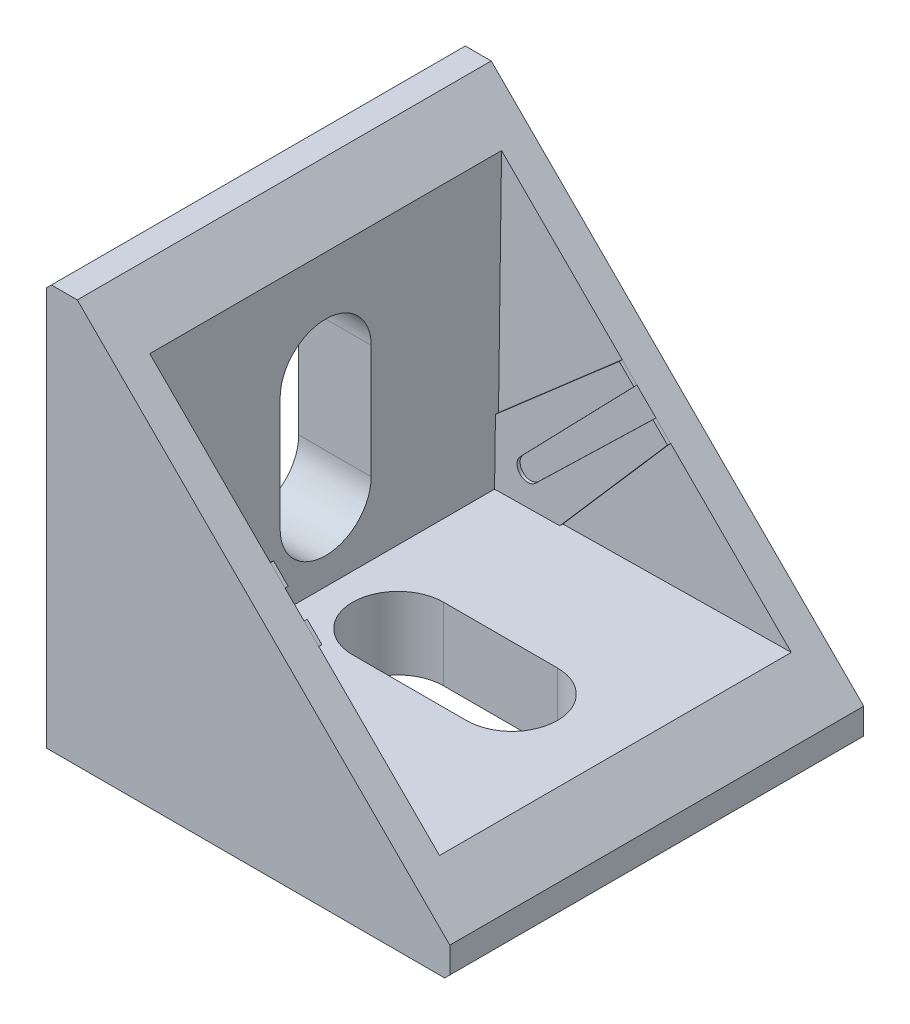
ISO-10303-21;
HEADER;
FILE_DESCRIPTION(('STEP AP214'),'2;1');
FILE_NAME('part.step','',(''),(''),'','','');
FILE_SCHEMA(('AUTOMOTIVE_DESIGN { 1 0 10303 214 1 1 1 1 }'));
ENDSEC;
DATA;
#1=APPLICATION_CONTEXT('core data for automotive mechanical design processes');
#2=APPLICATION_PROTOCOL_DEFINITION('international standard','automotive_design',2000,#1);
#3=PRODUCT_CONTEXT('',#1,'mechanical');
#4=PRODUCT('Part','Part','',(#3));
#5=PRODUCT_RELATED_PRODUCT_CATEGORY('part','',(#4));
#6=PRODUCT_DEFINITION_FORMATION('','',#4);
#7=PRODUCT_DEFINITION_CONTEXT('part definition',#1,'design');
#8=PRODUCT_DEFINITION('design','',#6,#7);
#9=PRODUCT_DEFINITION_SHAPE('','',#8);
#10=(LENGTH_UNIT() NAMED_UNIT(*) SI_UNIT(.MILLI.,.METRE.));
#11=(NAMED_UNIT(*) PLANE_ANGLE_UNIT() SI_UNIT($,.RADIAN.));
#12=(NAMED_UNIT(*) SI_UNIT($,.STERADIAN.) SOLID_ANGLE_UNIT());
#13=UNCERTAINTY_MEASURE_WITH_UNIT(LENGTH_MEASURE(1.E-05),#10,'distance_accuracy_value','');
#14=(GEOMETRIC_REPRESENTATION_CONTEXT(3) GLOBAL_UNCERTAINTY_ASSIGNED_CONTEXT((#13)) GLOBAL_UNIT_ASSIGNED_CONTEXT((#10,
#11,#12)) REPRESENTATION_CONTEXT('',''));
#15=CARTESIAN_POINT('',(0.,0.,0.));
#16=DIRECTION('',(0.,0.,1.));
#17=DIRECTION('',(1.,0.,0.));
#18=AXIS2_PLACEMENT_3D('',#15,#16,#17);
#19=CARTESIAN_POINT('',(21.9262869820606,20.0875791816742,-17.0101901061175));
#20=DIRECTION('',(-0.695506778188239,0.71851946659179,-0.000312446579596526));
#21=DIRECTION('',(-0.718391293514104,-0.695374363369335,0.0191948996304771));
#22=AXIS2_PLACEMENT_3D('',#19,#20,#21);
#23=PLANE('',#22);
#24=DIRECTION('',(-0.718391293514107,-0.695374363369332,0.0191948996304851));
#25=VECTOR('',#24,1.);
#26=CARTESIAN_POINT('',(21.9233112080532,20.0848335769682,-16.7000552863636));
#27=LINE('',#26,#25);
#28=CARTESIAN_POINT('',(21.9233112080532,20.0848335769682,-16.7000552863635));
#29=VERTEX_POINT('',#28);
#30=CARTESIAN_POINT('',(10.8822656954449,9.39753813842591,-16.4050464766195));
#31=VERTEX_POINT('',#30);
#32=EDGE_CURVE('E662',#29,#31,#27,.T.);
#33=ORIENTED_EDGE('',*,*,#32,.F.);
#34=DIRECTION('',(-0.0135746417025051,-0.0135746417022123,-0.999815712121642));
#35=VECTOR('',#34,1.);
#36=CARTESIAN_POINT('',(21.9212750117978,20.0827973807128,-16.8500276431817));
#37=LINE('',#36,#35);
#38=CARTESIAN_POINT('',(21.9192388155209,20.0807611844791,-17.));
#39=VERTEX_POINT('',#38);
#40=EDGE_CURVE('E701',#29,#39,#37,.T.);
#41=ORIENTED_EDGE('',*,*,#40,.T.);
#42=DIRECTION('',(0.718391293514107,0.695374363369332,-0.0191948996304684));
#43=VECTOR('',#42,1.);
#44=CARTESIAN_POINT('',(10.8781933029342,9.39346574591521,-16.704991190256));
#45=LINE('',#44,#43);
#46=CARTESIAN_POINT('',(10.8781933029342,9.39346574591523,-16.704991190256));
#47=VERTEX_POINT('',#46);
#48=EDGE_CURVE('E655',#47,#39,#45,.T.);
#49=ORIENTED_EDGE('',*,*,#48,.F.);
#50=DIRECTION('',(-0.0135746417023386,-0.013574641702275,-0.999815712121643));
#51=VECTOR('',#50,1.);
#52=CARTESIAN_POINT('',(10.8802294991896,9.39550194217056,-16.5550188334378));
#53=LINE('',#52,#51);
#54=EDGE_CURVE('E695',#31,#47,#53,.T.);
#55=ORIENTED_EDGE('',*,*,#54,.F.);
#56=EDGE_LOOP('',(#33,#41,#49,#55));
#57=FACE_BOUND('',#56,.T.);
#58=ADVANCED_FACE('F15',(#57),#23,.T.);
#59=CARTESIAN_POINT('',(9.38637625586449,10.8708736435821,-16.7147973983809));
#60=DIRECTION('',(0.718519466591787,-0.695506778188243,-0.000312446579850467));
#61=DIRECTION('',(0.695374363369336,0.718391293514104,-0.0191948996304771));
#62=AXIS2_PLACEMENT_3D('',#59,#60,#61);
#63=PLANE('',#62);
#64=DIRECTION('',(0.695374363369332,0.718391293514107,-0.0191948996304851));
#65=VECTOR('',#64,1.);
#66=CARTESIAN_POINT('',(9.39753813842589,10.8822656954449,-16.4050464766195));
#67=LINE('',#66,#65);
#68=CARTESIAN_POINT('',(9.39753813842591,10.8822656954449,-16.4050464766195));
#69=VERTEX_POINT('',#68);
#70=CARTESIAN_POINT('',(20.0848335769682,21.9233112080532,-16.7000552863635));
#71=VERTEX_POINT('',#70);
#72=EDGE_CURVE('E667',#69,#71,#67,.T.);
#73=ORIENTED_EDGE('',*,*,#72,.F.);
#74=DIRECTION('',(0.013574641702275,0.0135746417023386,0.999815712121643));
#75=VECTOR('',#74,1.);
#76=CARTESIAN_POINT('',(9.39550194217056,10.8802294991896,-16.5550188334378));
#77=LINE('',#76,#75);
#78=CARTESIAN_POINT('',(9.3934657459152,10.8781933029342,-16.704991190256));
#79=VERTEX_POINT('',#78);
#80=EDGE_CURVE('E698',#79,#69,#77,.T.);
#81=ORIENTED_EDGE('',*,*,#80,.F.);
#82=DIRECTION('',(-0.695374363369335,-0.718391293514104,0.0191948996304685));
#83=VECTOR('',#82,1.);
#84=CARTESIAN_POINT('',(20.0807611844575,21.9192388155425,-16.9999999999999));
#85=LINE('',#84,#83);
#86=CARTESIAN_POINT('',(20.0807611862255,21.9192388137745,-17.));
#87=VERTEX_POINT('',#86);
#88=EDGE_CURVE('E652',#87,#79,#85,.T.);
#89=ORIENTED_EDGE('',*,*,#88,.F.);
#90=DIRECTION('',(-0.0135746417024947,-0.0135746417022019,-0.999815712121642));
#91=VECTOR('',#90,1.);
#92=CARTESIAN_POINT('',(20.0827973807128,21.9212750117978,-16.8500276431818));
#93=LINE('',#92,#91);
#94=EDGE_CURVE('E658',#71,#87,#93,.T.);
#95=ORIENTED_EDGE('',*,*,#94,.F.);
#96=EDGE_LOOP('',(#73,#81,#89,#95));
#97=FACE_BOUND('',#96,.T.);
#98=ADVANCED_FACE('F1769',(#97),#63,.T.);
#99=CARTESIAN_POINT('',(10.1519835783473,10.1519835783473,-16.4053745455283));
#100=DIRECTION('',(-0.0135746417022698,-0.0135746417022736,-0.999815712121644));
#101=DIRECTION('',(0.,0.99990784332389,-0.0135758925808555));
#102=AXIS2_PLACEMENT_3D('',#99,#100,#101);
#103=CYLINDRICAL_SURFACE('',#102,1.04999999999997);
#104=CARTESIAN_POINT('',(10.1519835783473,10.1519835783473,-16.4053745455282));
#105=DIRECTION('',(-0.0135746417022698,-0.0135746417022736,-0.999815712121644));
#106=DIRECTION('',(0.,0.99990784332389,-0.0135758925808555));
#107=AXIS2_PLACEMENT_3D('',#104,#105,#106);
#108=CIRCLE('',#107,1.04999999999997);
#109=EDGE_CURVE('E659',#31,#69,#108,.T.);
#110=ORIENTED_EDGE('',*,*,#109,.F.);
#111=ORIENTED_EDGE('',*,*,#54,.T.);
#112=CARTESIAN_POINT('',(10.1479111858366,10.1479111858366,-16.7053192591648));
#113=DIRECTION('',(-0.0135746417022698,-0.0135746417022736,-0.999815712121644));
#114=DIRECTION('',(0.,0.99990784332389,-0.0135758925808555));
#115=AXIS2_PLACEMENT_3D('',#112,#113,#114);
#116=CIRCLE('',#115,1.04999999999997);
#117=EDGE_CURVE('E649',#79,#47,#116,.F.);
#118=ORIENTED_EDGE('',*,*,#117,.F.);
#119=ORIENTED_EDGE('',*,*,#80,.T.);
#120=EDGE_LOOP('',(#110,#111,#118,#119));
#121=FACE_BOUND('',#120,.T.);
#122=ADVANCED_FACE('F1759',(#121),#103,.F.);
#123=CARTESIAN_POINT('',(13.2095439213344,6.9923107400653,-16.7140452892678));
#124=DIRECTION('',(0.755472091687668,-0.655179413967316,-0.00136168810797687));
#125=DIRECTION('',(0.655040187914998,0.75535135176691,-0.0191490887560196));
#126=AXIS2_PLACEMENT_3D('',#123,#124,#125);
#127=PLANE('',#126);
#128=DIRECTION('',(0.655040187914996,0.755351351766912,-0.0191490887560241));
#129=VECTOR('',#128,1.);
#130=CARTESIAN_POINT('',(13.2203024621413,7.00407239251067,-16.4042939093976));
#131=LINE('',#130,#129);
#132=CARTESIAN_POINT('',(13.2203024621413,7.00407239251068,-16.4042939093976));
#133=VERTEX_POINT('',#132);
#134=CARTESIAN_POINT('',(23.3375247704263,18.6706200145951,-16.7000552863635));
#135=VERTEX_POINT('',#134);
#136=EDGE_CURVE('E665',#133,#135,#131,.T.);
#137=ORIENTED_EDGE('',*,*,#136,.F.);
#138=DIRECTION('',(0.0135746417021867,0.0135746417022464,0.999815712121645));
#139=VECTOR('',#138,1.);
#140=CARTESIAN_POINT('',(13.2182662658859,7.00203619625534,-16.5542662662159));
#141=LINE('',#140,#139);
#142=CARTESIAN_POINT('',(13.2162300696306,7.,-16.7042386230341));
#143=VERTEX_POINT('',#142);
#144=EDGE_CURVE('E439',#143,#133,#141,.T.);
#145=ORIENTED_EDGE('',*,*,#144,.F.);
#146=DIRECTION('',(-0.655040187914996,-0.755351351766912,0.0191490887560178));
#147=VECTOR('',#146,1.);
#148=CARTESIAN_POINT('',(23.3334523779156,18.6665476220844,-17.));
#149=LINE('',#148,#147);
#150=CARTESIAN_POINT('',(23.3334523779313,18.6665476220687,-17.));
#151=VERTEX_POINT('',#150);
#152=EDGE_CURVE('E446',#151,#143,#149,.T.);
#153=ORIENTED_EDGE('',*,*,#152,.F.);
#154=DIRECTION('',(-0.0135746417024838,-0.0135746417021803,-0.999815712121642));
#155=VECTOR('',#154,1.);
#156=CARTESIAN_POINT('',(23.3354885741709,18.6685838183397,-16.8500276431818));
#157=LINE('',#156,#155);
#158=EDGE_CURVE('E443',#135,#151,#157,.T.);
#159=ORIENTED_EDGE('',*,*,#158,.F.);
#160=EDGE_LOOP('',(#137,#145,#153,#159));
#161=FACE_BOUND('',#160,.T.);
#162=ADVANCED_FACE('F1750',(#161),#127,.T.);
#163=CARTESIAN_POINT('',(23.3398670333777,18.673965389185,17.0101896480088));
#164=DIRECTION('',(0.755472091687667,-0.655179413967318,0.00136168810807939));
#165=DIRECTION('',(-0.655040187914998,-0.75535135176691,-0.0191490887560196));
#166=AXIS2_PLACEMENT_3D('',#163,#164,#165);
#167=PLANE('',#166);
#168=DIRECTION('',(-0.655040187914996,-0.755351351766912,-0.0191490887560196));
#169=VECTOR('',#168,1.);
#170=CARTESIAN_POINT('',(23.3375247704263,18.6706200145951,16.7000552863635));
#171=LINE('',#170,#169);
#172=CARTESIAN_POINT('',(23.3375247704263,18.6706200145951,16.7000552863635));
#173=VERTEX_POINT('',#172);
#174=CARTESIAN_POINT('',(13.2203024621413,7.00407239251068,16.4042939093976));
#175=VERTEX_POINT('',#174);
#176=EDGE_CURVE('E670',#173,#175,#171,.T.);
#177=ORIENTED_EDGE('',*,*,#176,.F.);
#178=DIRECTION('',(-0.013574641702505,-0.0135746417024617,0.999815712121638));
#179=VECTOR('',#178,1.);
#180=CARTESIAN_POINT('',(23.3354885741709,18.6685838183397,16.8500276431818));
#181=LINE('',#180,#179);
#182=CARTESIAN_POINT('',(23.3334523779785,18.6665476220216,17.));
#183=VERTEX_POINT('',#182);
#184=EDGE_CURVE('E681',#173,#183,#181,.T.);
#185=ORIENTED_EDGE('',*,*,#184,.T.);
#186=DIRECTION('',(0.655040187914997,0.755351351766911,0.0191490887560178));
#187=VECTOR('',#186,1.);
#188=CARTESIAN_POINT('',(13.2162300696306,6.99999999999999,16.7042386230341));
#189=LINE('',#188,#187);
#190=CARTESIAN_POINT('',(13.2162300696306,7.00000000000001,16.7042386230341));
#191=VERTEX_POINT('',#190);
#192=EDGE_CURVE('E643',#191,#183,#189,.T.);
#193=ORIENTED_EDGE('',*,*,#192,.F.);
#194=DIRECTION('',(-0.0135746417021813,-0.0135746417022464,0.999815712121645));
#195=VECTOR('',#194,1.);
#196=CARTESIAN_POINT('',(13.218266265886,7.00203619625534,16.5542662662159));
#197=LINE('',#196,#195);
#198=EDGE_CURVE('E721',#175,#191,#197,.T.);
#199=ORIENTED_EDGE('',*,*,#198,.F.);
#200=EDGE_LOOP('',(#177,#185,#193,#199));
#201=FACE_BOUND('',#200,.T.);
#202=ADVANCED_FACE('F747',(#201),#167,.T.);
#203=CARTESIAN_POINT('',(10.8708736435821,9.3863762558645,16.7147973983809));
#204=DIRECTION('',(-0.695506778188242,0.718519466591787,0.000312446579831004));
#205=DIRECTION('',(0.718391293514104,0.695374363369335,0.0191948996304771));
#206=AXIS2_PLACEMENT_3D('',#203,#204,#205);
#207=PLANE('',#206);
#208=DIRECTION('',(0.718391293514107,0.695374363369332,0.019194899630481));
#209=VECTOR('',#208,1.);
#210=CARTESIAN_POINT('',(10.8822656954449,9.39753813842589,16.4050464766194));
#211=LINE('',#210,#209);
#212=CARTESIAN_POINT('',(10.8822656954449,9.39753813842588,16.4050464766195));
#213=VERTEX_POINT('',#212);
#214=CARTESIAN_POINT('',(21.9233112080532,20.0848335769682,16.7000552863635));
#215=VERTEX_POINT('',#214);
#216=EDGE_CURVE('E672',#213,#215,#211,.T.);
#217=ORIENTED_EDGE('',*,*,#216,.F.);
#218=DIRECTION('',(0.0135746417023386,0.013574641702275,-0.999815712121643));
#219=VECTOR('',#218,1.);
#220=CARTESIAN_POINT('',(10.8802294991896,9.39550194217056,16.5550188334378));
#221=LINE('',#220,#219);
#222=CARTESIAN_POINT('',(10.8781933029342,9.3934657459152,16.704991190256));
#223=VERTEX_POINT('',#222);
#224=EDGE_CURVE('E679',#223,#213,#221,.T.);
#225=ORIENTED_EDGE('',*,*,#224,.F.);
#226=DIRECTION('',(-0.718391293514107,-0.695374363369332,-0.0191948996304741));
#227=VECTOR('',#226,1.);
#228=CARTESIAN_POINT('',(21.9192388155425,20.0807611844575,17.));
#229=LINE('',#228,#227);
#230=CARTESIAN_POINT('',(21.9192388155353,20.0807611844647,17.));
#231=VERTEX_POINT('',#230);
#232=EDGE_CURVE('E639',#231,#223,#229,.T.);
#233=ORIENTED_EDGE('',*,*,#232,.F.);
#234=DIRECTION('',(-0.0135746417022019,-0.0135746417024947,0.999815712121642));
#235=VECTOR('',#234,1.);
#236=CARTESIAN_POINT('',(21.9212750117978,20.0827973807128,16.8500276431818));
#237=LINE('',#236,#235);
#238=EDGE_CURVE('E642',#215,#231,#237,.T.);
#239=ORIENTED_EDGE('',*,*,#238,.F.);
#240=EDGE_LOOP('',(#217,#225,#233,#239));
#241=FACE_BOUND('',#240,.T.);
#242=ADVANCED_FACE('F683',(#241),#207,.T.);
#243=CARTESIAN_POINT('',(10.1479111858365,10.1479111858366,16.7053192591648));
#244=DIRECTION('',(0.0135746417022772,0.0135746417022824,-0.999815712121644));
#245=DIRECTION('',(0.,0.99990784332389,0.0135758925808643));
#246=AXIS2_PLACEMENT_3D('',#243,#244,#245);
#247=CYLINDRICAL_SURFACE('',#246,1.04999999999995);
#248=CARTESIAN_POINT('',(10.1519835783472,10.1519835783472,16.4053745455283));
#249=DIRECTION('',(0.0135746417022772,0.0135746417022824,-0.999815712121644));
#250=DIRECTION('',(0.,0.99990784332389,0.0135758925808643));
#251=AXIS2_PLACEMENT_3D('',#248,#249,#250);
#252=CIRCLE('',#251,1.04999999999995);
#253=CARTESIAN_POINT('',(9.39753813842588,10.8822656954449,16.4050464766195));
#254=VERTEX_POINT('',#253);
#255=EDGE_CURVE('E410',#254,#213,#252,.F.);
#256=ORIENTED_EDGE('',*,*,#255,.F.);
#257=DIRECTION('',(0.0135746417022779,0.013574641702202,-0.999815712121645));
#258=VECTOR('',#257,1.);
#259=CARTESIAN_POINT('',(9.39550194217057,10.8802294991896,16.5550188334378));
#260=LINE('',#259,#258);
#261=CARTESIAN_POINT('',(9.39346574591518,10.8781933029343,16.704991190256));
#262=VERTEX_POINT('',#261);
#263=EDGE_CURVE('E402',#262,#254,#260,.T.);
#264=ORIENTED_EDGE('',*,*,#263,.F.);
#265=CARTESIAN_POINT('',(10.1479111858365,10.1479111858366,16.7053192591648));
#266=DIRECTION('',(0.0135746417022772,0.0135746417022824,-0.999815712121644));
#267=DIRECTION('',(0.,0.99990784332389,0.0135758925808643));
#268=AXIS2_PLACEMENT_3D('',#265,#266,#267);
#269=CIRCLE('',#268,1.04999999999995);
#270=EDGE_CURVE('E421',#223,#262,#269,.T.);
#271=ORIENTED_EDGE('',*,*,#270,.F.);
#272=ORIENTED_EDGE('',*,*,#224,.T.);
#273=EDGE_LOOP('',(#256,#264,#271,#272));
#274=FACE_BOUND('',#273,.T.);
#275=ADVANCED_FACE('F677',(#274),#247,.F.);
#276=CARTESIAN_POINT('',(20.0875791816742,21.9262869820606,17.0101901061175));
#277=DIRECTION('',(0.71851946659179,-0.695506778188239,0.000312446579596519));
#278=DIRECTION('',(-0.695374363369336,-0.718391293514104,-0.0191948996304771));
#279=AXIS2_PLACEMENT_3D('',#276,#277,#278);
#280=PLANE('',#279);
#281=DIRECTION('',(-0.695374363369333,-0.718391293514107,-0.0191948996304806));
#282=VECTOR('',#281,1.);
#283=CARTESIAN_POINT('',(20.0848335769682,21.9233112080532,16.7000552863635));
#284=LINE('',#283,#282);
#285=CARTESIAN_POINT('',(20.0848335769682,21.9233112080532,16.7000552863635));
#286=VERTEX_POINT('',#285);
#287=EDGE_CURVE('E19',#286,#254,#284,.T.);
#288=ORIENTED_EDGE('',*,*,#287,.F.);
#289=DIRECTION('',(-0.0135746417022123,-0.0135746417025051,0.999815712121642));
#290=VECTOR('',#289,1.);
#291=CARTESIAN_POINT('',(20.0827973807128,21.9212750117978,16.8500276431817));
#292=LINE('',#291,#290);
#293=CARTESIAN_POINT('',(20.0807611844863,21.9192388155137,17.));
#294=VERTEX_POINT('',#293);
#295=EDGE_CURVE('E389',#286,#294,#292,.T.);
#296=ORIENTED_EDGE('',*,*,#295,.T.);
#297=DIRECTION('',(0.695374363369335,0.718391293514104,0.0191948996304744));
#298=VECTOR('',#297,1.);
#299=CARTESIAN_POINT('',(9.39346574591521,10.8781933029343,16.704991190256));
#300=LINE('',#299,#298);
#301=EDGE_CURVE('E417',#262,#294,#300,.T.);
#302=ORIENTED_EDGE('',*,*,#301,.F.);
#303=ORIENTED_EDGE('',*,*,#263,.T.);
#304=EDGE_LOOP('',(#288,#296,#302,#303));
#305=FACE_BOUND('',#304,.T.);
#306=ADVANCED_FACE('F406',(#305),#280,.T.);
#307=CARTESIAN_POINT('',(6.9923107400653,13.2095439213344,16.7140452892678));
#308=DIRECTION('',(-0.655179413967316,0.755472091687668,0.00136168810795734));
#309=DIRECTION('',(0.75535135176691,0.655040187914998,0.0191490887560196));
#310=AXIS2_PLACEMENT_3D('',#307,#308,#309);
#311=PLANE('',#310);
#312=DIRECTION('',(0.755351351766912,0.655040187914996,0.0191490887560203));
#313=VECTOR('',#312,1.);
#314=CARTESIAN_POINT('',(7.00407239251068,13.2203024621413,16.4042939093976));
#315=LINE('',#314,#313);
#316=CARTESIAN_POINT('',(7.00407239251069,13.2203024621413,16.4042939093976));
#317=VERTEX_POINT('',#316);
#318=CARTESIAN_POINT('',(18.6706200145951,23.3375247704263,16.7000552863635));
#319=VERTEX_POINT('',#318);
#320=EDGE_CURVE('E414',#317,#319,#315,.T.);
#321=ORIENTED_EDGE('',*,*,#320,.F.);
#322=DIRECTION('',(-0.0135746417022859,-0.013574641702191,0.999815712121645));
#323=VECTOR('',#322,1.);
#324=CARTESIAN_POINT('',(7.00203619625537,13.2182662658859,16.5542662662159));
#325=LINE('',#324,#323);
#326=CARTESIAN_POINT('',(7.00000000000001,13.2162300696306,16.7042386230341));
#327=VERTEX_POINT('',#326);
#328=EDGE_CURVE('E401',#317,#327,#325,.T.);
#329=ORIENTED_EDGE('',*,*,#328,.T.);
#330=DIRECTION('',(-0.755351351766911,-0.655040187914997,-0.0191490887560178));
#331=VECTOR('',#330,1.);
#332=CARTESIAN_POINT('',(18.6665476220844,23.3334523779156,17.));
#333=LINE('',#332,#331);
#334=CARTESIAN_POINT('',(18.6665476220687,23.3334523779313,17.));
#335=VERTEX_POINT('',#334);
#336=EDGE_CURVE('E419',#335,#327,#333,.T.);
#337=ORIENTED_EDGE('',*,*,#336,.F.);
#338=DIRECTION('',(-0.0135746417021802,-0.0135746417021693,0.999815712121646));
#339=VECTOR('',#338,1.);
#340=CARTESIAN_POINT('',(18.6685838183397,23.3354885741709,16.8500276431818));
#341=LINE('',#340,#339);
#342=EDGE_CURVE('E416',#319,#335,#341,.T.);
#343=ORIENTED_EDGE('',*,*,#342,.F.);
#344=EDGE_LOOP('',(#321,#329,#337,#343));
#345=FACE_BOUND('',#344,.T.);
#346=ADVANCED_FACE('F765',(#345),#311,.T.);
#347=CARTESIAN_POINT('',(23.3496758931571,6.9940733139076,16.5416861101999));
#348=DIRECTION('',(0.0135746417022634,0.0135746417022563,-0.999815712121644));
#349=DIRECTION('',(-0.99990784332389,0.,-0.0135758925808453));
#350=AXIS2_PLACEMENT_3D('',#347,#348,#349);
#351=PLANE('',#350);
#352=ORIENTED_EDGE('',*,*,#320,.T.);
#353=DIRECTION('',(-0.707106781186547,0.707106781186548,0.));
#354=VECTOR('',#353,1.);
#355=CARTESIAN_POINT('',(19.3777267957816,22.6304179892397,16.7000552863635));
#356=LINE('',#355,#354);
#357=EDGE_CURVE('E394',#286,#319,#356,.T.);
#358=ORIENTED_EDGE('',*,*,#357,.F.);
#359=ORIENTED_EDGE('',*,*,#287,.T.);
#360=ORIENTED_EDGE('',*,*,#255,.T.);
#361=ORIENTED_EDGE('',*,*,#216,.T.);
#362=DIRECTION('',(-0.707106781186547,0.707106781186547,0.));
#363=VECTOR('',#362,1.);
#364=CARTESIAN_POINT('',(22.6304179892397,19.3777267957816,16.7000552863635));
#365=LINE('',#364,#363);
#366=EDGE_CURVE('E646',#173,#215,#365,.T.);
#367=ORIENTED_EDGE('',*,*,#366,.F.);
#368=ORIENTED_EDGE('',*,*,#176,.T.);
#369=DIRECTION('',(0.99990784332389,0.,0.0135758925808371));
#370=VECTOR('',#369,1.);
#371=CARTESIAN_POINT('',(10.112187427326,7.00407239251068,16.3620945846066));
#372=LINE('',#371,#370);
#373=CARTESIAN_POINT('',(7.00407239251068,7.00407239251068,16.3198952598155));
#374=VERTEX_POINT('',#373);
#375=EDGE_CURVE('E425',#374,#175,#372,.T.);
#376=ORIENTED_EDGE('',*,*,#375,.F.);
#377=DIRECTION('',(0.,-0.99990784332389,-0.0135758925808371));
#378=VECTOR('',#377,1.);
#379=CARTESIAN_POINT('',(7.00407239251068,10.112187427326,16.3620945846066));
#380=LINE('',#379,#378);
#381=EDGE_CURVE('E433',#317,#374,#380,.T.);
#382=ORIENTED_EDGE('',*,*,#381,.F.);
#383=EDGE_LOOP('',(#352,#358,#359,#360,#361,#367,#368,#376,#382));
#384=FACE_BOUND('',#383,.T.);
#385=ADVANCED_FACE('F411',(#384),#351,.T.);
#386=CARTESIAN_POINT('',(6.99407515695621,6.9940733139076,-16.3196237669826));
#387=DIRECTION('',(0.0135746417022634,0.0135746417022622,0.999815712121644));
#388=DIRECTION('',(0.99990784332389,0.,-0.0135758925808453));
#389=AXIS2_PLACEMENT_3D('',#386,#387,#388);
#390=PLANE('',#389);
#391=ORIENTED_EDGE('',*,*,#32,.T.);
#392=ORIENTED_EDGE('',*,*,#109,.T.);
#393=ORIENTED_EDGE('',*,*,#72,.T.);
#394=DIRECTION('',(0.707106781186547,-0.707106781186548,0.));
#395=VECTOR('',#394,1.);
#396=CARTESIAN_POINT('',(19.3777267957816,22.6304179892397,-16.7000552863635));
#397=LINE('',#396,#395);
#398=CARTESIAN_POINT('',(18.6706200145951,23.3375247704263,-16.7000552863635));
#399=VERTEX_POINT('',#398);
#400=EDGE_CURVE('E704',#399,#71,#397,.T.);
#401=ORIENTED_EDGE('',*,*,#400,.F.);
#402=DIRECTION('',(0.755351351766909,0.655040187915,-0.0191490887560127));
#403=VECTOR('',#402,1.);
#404=CARTESIAN_POINT('',(12.8373462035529,18.2789136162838,-16.5521745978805));
#405=LINE('',#404,#403);
#406=CARTESIAN_POINT('',(7.00407239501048,13.2203024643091,-16.404293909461));
#407=VERTEX_POINT('',#406);
#408=EDGE_CURVE('E442',#407,#399,#405,.T.);
#409=ORIENTED_EDGE('',*,*,#408,.F.);
#410=DIRECTION('',(0.,0.99990784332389,-0.0135758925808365));
#411=VECTOR('',#410,1.);
#412=CARTESIAN_POINT('',(7.00407239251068,10.112187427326,-16.3620945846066));
#413=LINE('',#412,#411);
#414=CARTESIAN_POINT('',(7.00407239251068,7.00407239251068,-16.3198952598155));
#415=VERTEX_POINT('',#414);
#416=EDGE_CURVE('E467',#415,#407,#413,.T.);
#417=ORIENTED_EDGE('',*,*,#416,.F.);
#418=DIRECTION('',(-0.99990784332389,0.,0.0135758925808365));
#419=VECTOR('',#418,1.);
#420=CARTESIAN_POINT('',(10.112187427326,7.00407239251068,-16.3620945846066));
#421=LINE('',#420,#419);
#422=EDGE_CURVE('E437',#133,#415,#421,.T.);
#423=ORIENTED_EDGE('',*,*,#422,.F.);
#424=ORIENTED_EDGE('',*,*,#136,.T.);
#425=DIRECTION('',(0.707106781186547,-0.707106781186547,0.));
#426=VECTOR('',#425,1.);
#427=CARTESIAN_POINT('',(22.6304179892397,19.3777267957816,-16.7000552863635));
#428=LINE('',#427,#426);
#429=EDGE_CURVE('E447',#29,#135,#428,.T.);
#430=ORIENTED_EDGE('',*,*,#429,.F.);
#431=EDGE_LOOP('',(#391,#392,#393,#401,#409,#417,#423,#424,#430));
#432=FACE_BOUND('',#431,.T.);
#433=ADVANCED_FACE('F1691',(#432),#390,.T.);
#434=CARTESIAN_POINT('',(18.673965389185,23.3398670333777,-17.0101896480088));
#435=DIRECTION('',(-0.655179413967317,0.755472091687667,-0.00136168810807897));
#436=DIRECTION('',(-0.75535135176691,-0.655040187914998,0.0191490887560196));
#437=AXIS2_PLACEMENT_3D('',#434,#435,#436);
#438=PLANE('',#437);
#439=ORIENTED_EDGE('',*,*,#408,.T.);
#440=DIRECTION('',(0.0135746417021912,0.0135746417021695,0.999815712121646));
#441=VECTOR('',#440,1.);
#442=CARTESIAN_POINT('',(18.6685838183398,23.3354885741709,-16.8500276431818));
#443=LINE('',#442,#441);
#444=CARTESIAN_POINT('',(18.666547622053,23.333452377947,-17.));
#445=VERTEX_POINT('',#444);
#446=EDGE_CURVE('E716',#445,#399,#443,.T.);
#447=ORIENTED_EDGE('',*,*,#446,.F.);
#448=DIRECTION('',(0.755351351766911,0.655040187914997,-0.0191490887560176));
#449=VECTOR('',#448,1.);
#450=CARTESIAN_POINT('',(7.,13.2162300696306,-16.7042386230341));
#451=LINE('',#450,#449);
#452=CARTESIAN_POINT('',(7.,13.2162300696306,-16.7042386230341));
#453=VERTEX_POINT('',#452);
#454=EDGE_CURVE('E630',#453,#445,#451,.T.);
#455=ORIENTED_EDGE('',*,*,#454,.F.);
#456=DIRECTION('',(-0.0135746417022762,-0.0135746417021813,-0.999815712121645));
#457=VECTOR('',#456,1.);
#458=CARTESIAN_POINT('',(7.00203619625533,13.218266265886,-16.5542662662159));
#459=LINE('',#458,#457);
#460=EDGE_CURVE('E634',#407,#453,#459,.T.);
#461=ORIENTED_EDGE('',*,*,#460,.F.);
#462=EDGE_LOOP('',(#439,#447,#455,#461));
#463=FACE_BOUND('',#462,.T.);
#464=ADVANCED_FACE('F1681',(#463),#438,.T.);
#465=CARTESIAN_POINT('',(6.98986517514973,6.99986425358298,-16.6297023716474));
#466=DIRECTION('',(0.000184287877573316,-0.999907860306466,0.013573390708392));
#467=DIRECTION('',(0.99990784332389,0.,-0.0135758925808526));
#468=AXIS2_PLACEMENT_3D('',#465,#466,#467);
#469=PLANE('',#468);
#470=ORIENTED_EDGE('',*,*,#422,.T.);
#471=DIRECTION('',(0.0135746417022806,0.0135746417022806,0.999815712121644));
#472=VECTOR('',#471,1.);
#473=CARTESIAN_POINT('',(7.00203619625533,7.00203619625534,-16.4698676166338));
#474=LINE('',#473,#472);
#475=CARTESIAN_POINT('',(7.00000000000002,7.00000000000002,-16.6198399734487));
#476=VERTEX_POINT('',#475);
#477=EDGE_CURVE('E457',#476,#415,#474,.T.);
#478=ORIENTED_EDGE('',*,*,#477,.F.);
#479=DIRECTION('',(-0.99990784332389,0.,0.0135758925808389));
#480=VECTOR('',#479,1.);
#481=CARTESIAN_POINT('',(13.2162300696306,7.,-16.7042386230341));
#482=LINE('',#481,#480);
#483=EDGE_CURVE('E623',#143,#476,#482,.T.);
#484=ORIENTED_EDGE('',*,*,#483,.F.);
#485=ORIENTED_EDGE('',*,*,#144,.T.);
#486=EDGE_LOOP('',(#470,#478,#484,#485));
#487=FACE_BOUND('',#486,.T.);
#488=ADVANCED_FACE('F1672',(#487),#469,.T.);
#489=CARTESIAN_POINT('',(13.2260934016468,6.99986425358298,16.7143725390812));
#490=DIRECTION('',(0.000184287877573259,-0.999907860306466,-0.0135733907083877));
#491=DIRECTION('',(-0.99990784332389,0.,-0.0135758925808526));
#492=AXIS2_PLACEMENT_3D('',#489,#490,#491);
#493=PLANE('',#492);
#494=ORIENTED_EDGE('',*,*,#375,.T.);
#495=ORIENTED_EDGE('',*,*,#198,.T.);
#496=DIRECTION('',(0.99990784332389,0.,0.0135758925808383));
#497=VECTOR('',#496,1.);
#498=CARTESIAN_POINT('',(7.,7.,16.619839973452));
#499=LINE('',#498,#497);
#500=CARTESIAN_POINT('',(7.00000000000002,7.00000000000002,16.6198399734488));
#501=VERTEX_POINT('',#500);
#502=EDGE_CURVE('E620',#501,#191,#499,.T.);
#503=ORIENTED_EDGE('',*,*,#502,.F.);
#504=DIRECTION('',(-0.0135746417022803,-0.0135746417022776,0.999815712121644));
#505=VECTOR('',#504,1.);
#506=CARTESIAN_POINT('',(7.00203619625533,7.00203619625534,16.4698676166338));
#507=LINE('',#506,#505);
#508=EDGE_CURVE('E435',#374,#501,#507,.T.);
#509=ORIENTED_EDGE('',*,*,#508,.F.);
#510=EDGE_LOOP('',(#494,#495,#503,#509));
#511=FACE_BOUND('',#510,.T.);
#512=ADVANCED_FACE('F745',(#511),#493,.T.);
#513=CARTESIAN_POINT('',(20.0876965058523,21.9120320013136,-17.0099981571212));
#514=DIRECTION('',(0.706976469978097,0.706976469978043,-0.0191974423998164));
#515=DIRECTION('',(-0.70710678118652,0.707106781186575,0.));
#516=AXIS2_PLACEMENT_3D('',#513,#514,#515);
#517=PLANE('',#516);
#518=ORIENTED_EDGE('',*,*,#400,.T.);
#519=ORIENTED_EDGE('',*,*,#94,.T.);
#520=DIRECTION('',(0.707106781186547,-0.707106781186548,0.));
#521=VECTOR('',#520,1.);
#522=CARTESIAN_POINT('',(21.,21.,-17.));
#523=LINE('',#522,#521);
#524=EDGE_CURVE('E708',#445,#87,#523,.T.);
#525=ORIENTED_EDGE('',*,*,#524,.F.);
#526=ORIENTED_EDGE('',*,*,#446,.T.);
#527=EDGE_LOOP('',(#518,#519,#525,#526));
#528=FACE_BOUND('',#527,.T.);
#529=ADVANCED_FACE('F1653',(#528),#517,.T.);
#530=CARTESIAN_POINT('',(8.66524736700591,8.66524736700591,-16.6650585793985));
#531=DIRECTION('',(0.0135746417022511,0.0135746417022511,0.999815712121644));
#532=DIRECTION('',(0.999907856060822,-9.21439391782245E-05,-0.0135746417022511));
#533=AXIS2_PLACEMENT_3D('',#530,#531,#532);
#534=PLANE('',#533);
#535=ORIENTED_EDGE('',*,*,#88,.T.);
#536=ORIENTED_EDGE('',*,*,#117,.T.);
#537=ORIENTED_EDGE('',*,*,#48,.T.);
#538=DIRECTION('',(0.707106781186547,-0.707106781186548,0.));
#539=VECTOR('',#538,1.);
#540=CARTESIAN_POINT('',(21.,21.,-17.));
#541=LINE('',#540,#539);
#542=EDGE_CURVE('E705',#87,#39,#541,.T.);
#543=ORIENTED_EDGE('',*,*,#542,.F.);
#544=EDGE_LOOP('',(#535,#536,#537,#543));
#545=FACE_BOUND('',#544,.T.);
#546=ADVANCED_FACE('F1643',(#545),#534,.T.);
#547=CARTESIAN_POINT('',(23.3403876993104,18.6593408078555,-17.0099981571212));
#548=DIRECTION('',(0.706976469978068,0.706976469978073,-0.0191974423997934));
#549=DIRECTION('',(-0.70710678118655,0.707106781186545,0.));
#550=AXIS2_PLACEMENT_3D('',#547,#548,#549);
#551=PLANE('',#550);
#552=ORIENTED_EDGE('',*,*,#429,.T.);
#553=ORIENTED_EDGE('',*,*,#158,.T.);
#554=DIRECTION('',(0.707106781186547,-0.707106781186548,0.));
#555=VECTOR('',#554,1.);
#556=CARTESIAN_POINT('',(21.,21.,-17.));
#557=LINE('',#556,#555);
#558=EDGE_CURVE('E451',#39,#151,#557,.T.);
#559=ORIENTED_EDGE('',*,*,#558,.F.);
#560=ORIENTED_EDGE('',*,*,#40,.F.);
#561=EDGE_LOOP('',(#552,#553,#559,#560));
#562=FACE_BOUND('',#561,.T.);
#563=ADVANCED_FACE('F1633',(#562),#551,.T.);
#564=CARTESIAN_POINT('',(13.2062319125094,6.99000184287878,-16.7039671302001));
#565=DIRECTION('',(0.0135746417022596,0.0135746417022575,0.999815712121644));
#566=DIRECTION('',(0.999907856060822,-9.21439391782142E-05,-0.0135746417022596));
#567=AXIS2_PLACEMENT_3D('',#564,#565,#566);
#568=PLANE('',#567);
#569=DIRECTION('',(-0.99990784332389,0.,0.0135758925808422));
#570=VECTOR('',#569,1.);
#571=CARTESIAN_POINT('',(35.,7.00000000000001,-17.));
#572=LINE('',#571,#570);
#573=CARTESIAN_POINT('',(35.,7.00000000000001,-17.));
#574=VERTEX_POINT('',#573);
#575=EDGE_CURVE('E626',#574,#143,#572,.T.);
#576=ORIENTED_EDGE('',*,*,#575,.F.);
#577=DIRECTION('',(0.707106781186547,-0.707106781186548,0.));
#578=VECTOR('',#577,1.);
#579=CARTESIAN_POINT('',(21.,21.,-17.));
#580=LINE('',#579,#578);
#581=EDGE_CURVE('E448',#151,#574,#580,.T.);
#582=ORIENTED_EDGE('',*,*,#581,.F.);
#583=ORIENTED_EDGE('',*,*,#152,.T.);
#584=EDGE_LOOP('',(#576,#582,#583));
#585=FACE_BOUND('',#584,.T.);
#586=ADVANCED_FACE('F1624',(#585),#568,.T.);
#587=CARTESIAN_POINT('',(35.0100001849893,6.98799257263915,16.9999727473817));
#588=DIRECTION('',(0.0135746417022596,0.0135746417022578,-0.999815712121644));
#589=DIRECTION('',(-0.999907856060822,9.21439391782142E-05,-0.0135746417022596));
#590=AXIS2_PLACEMENT_3D('',#587,#588,#589);
#591=PLANE('',#590);
#592=DIRECTION('',(-0.707106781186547,0.707106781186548,0.));
#593=VECTOR('',#592,1.);
#594=CARTESIAN_POINT('',(21.,21.,17.));
#595=LINE('',#594,#593);
#596=CARTESIAN_POINT('',(35.,7.00000000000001,17.));
#597=VERTEX_POINT('',#596);
#598=EDGE_CURVE('E427',#597,#183,#595,.T.);
#599=ORIENTED_EDGE('',*,*,#598,.F.);
#600=DIRECTION('',(0.99990784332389,0.,0.0135758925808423));
#601=VECTOR('',#600,1.);
#602=CARTESIAN_POINT('',(13.2162300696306,7.,16.7042386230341));
#603=LINE('',#602,#601);
#604=EDGE_CURVE('E481',#191,#597,#603,.T.);
#605=ORIENTED_EDGE('',*,*,#604,.F.);
#606=ORIENTED_EDGE('',*,*,#192,.T.);
#607=EDGE_LOOP('',(#599,#605,#606));
#608=FACE_BOUND('',#607,.T.);
#609=ADVANCED_FACE('F750',(#608),#591,.T.);
#610=CARTESIAN_POINT('',(21.9120320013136,20.0876965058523,17.0099981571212));
#611=DIRECTION('',(0.706976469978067,0.706976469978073,0.0191974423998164));
#612=DIRECTION('',(0.70710678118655,-0.707106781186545,0.));
#613=AXIS2_PLACEMENT_3D('',#610,#611,#612);
#614=PLANE('',#613);
#615=ORIENTED_EDGE('',*,*,#366,.T.);
#616=ORIENTED_EDGE('',*,*,#238,.T.);
#617=DIRECTION('',(-0.707106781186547,0.707106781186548,0.));
#618=VECTOR('',#617,1.);
#619=CARTESIAN_POINT('',(21.,21.,17.));
#620=LINE('',#619,#618);
#621=EDGE_CURVE('E430',#183,#231,#620,.T.);
#622=ORIENTED_EDGE('',*,*,#621,.F.);
#623=ORIENTED_EDGE('',*,*,#184,.F.);
#624=EDGE_LOOP('',(#615,#616,#622,#623));
#625=FACE_BOUND('',#624,.T.);
#626=ADVANCED_FACE('F690',(#625),#614,.T.);
#627=CARTESIAN_POINT('',(21.9302899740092,8.66402496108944,16.845143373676));
#628=DIRECTION('',(0.0135746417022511,0.0135746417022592,-0.999815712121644));
#629=DIRECTION('',(-0.999907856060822,9.21439391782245E-05,-0.0135746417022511));
#630=AXIS2_PLACEMENT_3D('',#627,#628,#629);
#631=PLANE('',#630);
#632=ORIENTED_EDGE('',*,*,#301,.T.);
#633=DIRECTION('',(-0.707106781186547,0.707106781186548,0.));
#634=VECTOR('',#633,1.);
#635=CARTESIAN_POINT('',(21.,21.,17.));
#636=LINE('',#635,#634);
#637=EDGE_CURVE('E753',#231,#294,#636,.T.);
#638=ORIENTED_EDGE('',*,*,#637,.F.);
#639=ORIENTED_EDGE('',*,*,#232,.T.);
#640=ORIENTED_EDGE('',*,*,#270,.T.);
#641=EDGE_LOOP('',(#632,#638,#639,#640));
#642=FACE_BOUND('',#641,.T.);
#643=ADVANCED_FACE('F1598',(#642),#631,.T.);
#644=CARTESIAN_POINT('',(18.6593408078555,23.3403876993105,17.0099981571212));
#645=DIRECTION('',(0.706976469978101,0.706976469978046,0.0191974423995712));
#646=DIRECTION('',(0.70710678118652,-0.707106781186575,0.));
#647=AXIS2_PLACEMENT_3D('',#644,#645,#646);
#648=PLANE('',#647);
#649=ORIENTED_EDGE('',*,*,#357,.T.);
#650=ORIENTED_EDGE('',*,*,#342,.T.);
#651=DIRECTION('',(-0.707106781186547,0.707106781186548,0.));
#652=VECTOR('',#651,1.);
#653=CARTESIAN_POINT('',(21.,21.,17.));
#654=LINE('',#653,#652);
#655=EDGE_CURVE('E396',#294,#335,#654,.T.);
#656=ORIENTED_EDGE('',*,*,#655,.F.);
#657=ORIENTED_EDGE('',*,*,#295,.F.);
#658=EDGE_LOOP('',(#649,#650,#656,#657));
#659=FACE_BOUND('',#658,.T.);
#660=ADVANCED_FACE('F391',(#659),#648,.T.);
#661=CARTESIAN_POINT('',(18.6774800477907,13.2051548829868,16.8626350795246));
#662=DIRECTION('',(0.0135746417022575,0.0135746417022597,-0.999815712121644));
#663=DIRECTION('',(-0.999907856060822,9.21439391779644E-05,-0.0135746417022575));
#664=AXIS2_PLACEMENT_3D('',#661,#662,#663);
#665=PLANE('',#664);
#666=DIRECTION('',(0.,-0.99990784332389,-0.0135758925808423));
#667=VECTOR('',#666,1.);
#668=CARTESIAN_POINT('',(6.99999999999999,35.,17.));
#669=LINE('',#668,#667);
#670=CARTESIAN_POINT('',(6.99999999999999,35.,17.));
#671=VERTEX_POINT('',#670);
#672=EDGE_CURVE('E471',#671,#327,#669,.T.);
#673=ORIENTED_EDGE('',*,*,#672,.F.);
#674=DIRECTION('',(-0.707106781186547,0.707106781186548,0.));
#675=VECTOR('',#674,1.);
#676=CARTESIAN_POINT('',(21.,21.,17.));
#677=LINE('',#676,#675);
#678=EDGE_CURVE('E452',#335,#671,#677,.T.);
#679=ORIENTED_EDGE('',*,*,#678,.F.);
#680=ORIENTED_EDGE('',*,*,#336,.T.);
#681=EDGE_LOOP('',(#673,#679,#680));
#682=FACE_BOUND('',#681,.T.);
#683=ADVANCED_FACE('F769',(#682),#665,.T.);
#684=CARTESIAN_POINT('',(6.99986425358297,6.98986517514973,16.6297023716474));
#685=DIRECTION('',(-0.999907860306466,0.000184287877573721,-0.0135733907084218));
#686=DIRECTION('',(0.,0.99990784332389,0.0135758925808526));
#687=AXIS2_PLACEMENT_3D('',#684,#685,#686);
#688=PLANE('',#687);
#689=ORIENTED_EDGE('',*,*,#381,.T.);
#690=ORIENTED_EDGE('',*,*,#508,.T.);
#691=DIRECTION('',(0.,-0.99990784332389,-0.0135758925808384));
#692=VECTOR('',#691,1.);
#693=CARTESIAN_POINT('',(7.,13.2162300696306,16.7042386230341));
#694=LINE('',#693,#692);
#695=EDGE_CURVE('E462',#327,#501,#694,.T.);
#696=ORIENTED_EDGE('',*,*,#695,.F.);
#697=ORIENTED_EDGE('',*,*,#328,.F.);
#698=EDGE_LOOP('',(#689,#690,#696,#697));
#699=FACE_BOUND('',#698,.T.);
#700=ADVANCED_FACE('F763',(#699),#688,.T.);
#701=CARTESIAN_POINT('',(6.99986425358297,13.2260934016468,-16.7143725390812));
#702=DIRECTION('',(-0.999907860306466,0.000184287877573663,0.0135733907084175));
#703=DIRECTION('',(0.,-0.99990784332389,0.0135758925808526));
#704=AXIS2_PLACEMENT_3D('',#701,#702,#703);
#705=PLANE('',#704);
#706=ORIENTED_EDGE('',*,*,#416,.T.);
#707=ORIENTED_EDGE('',*,*,#460,.T.);
#708=DIRECTION('',(0.,0.99990784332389,-0.0135758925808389));
#709=VECTOR('',#708,1.);
#710=CARTESIAN_POINT('',(7.,7.00000000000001,-16.619839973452));
#711=LINE('',#710,#709);
#712=EDGE_CURVE('E461',#476,#453,#711,.T.);
#713=ORIENTED_EDGE('',*,*,#712,.F.);
#714=ORIENTED_EDGE('',*,*,#477,.T.);
#715=EDGE_LOOP('',(#706,#707,#713,#714));
#716=FACE_BOUND('',#715,.T.);
#717=ADVANCED_FACE('F1563',(#716),#705,.T.);
#718=CARTESIAN_POINT('',(6.99000184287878,13.2062319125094,-16.7039671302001));
#719=DIRECTION('',(0.0135746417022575,0.0135746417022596,0.999815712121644));
#720=DIRECTION('',(0.999907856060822,-9.21439391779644E-05,-0.0135746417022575));
#721=AXIS2_PLACEMENT_3D('',#718,#719,#720);
#722=PLANE('',#721);
#723=DIRECTION('',(0.707106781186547,-0.707106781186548,0.));
#724=VECTOR('',#723,1.);
#725=CARTESIAN_POINT('',(21.,21.,-17.));
#726=LINE('',#725,#724);
#727=CARTESIAN_POINT('',(6.99999999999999,35.,-17.));
#728=VERTEX_POINT('',#727);
#729=EDGE_CURVE('E480',#728,#445,#726,.T.);
#730=ORIENTED_EDGE('',*,*,#729,.F.);
#731=DIRECTION('',(0.,0.99990784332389,-0.0135758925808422));
#732=VECTOR('',#731,1.);
#733=CARTESIAN_POINT('',(7.,13.2162300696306,-16.7042386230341));
#734=LINE('',#733,#732);
#735=EDGE_CURVE('E609',#453,#728,#734,.T.);
#736=ORIENTED_EDGE('',*,*,#735,.F.);
#737=ORIENTED_EDGE('',*,*,#454,.T.);
#738=EDGE_LOOP('',(#730,#736,#737));
#739=FACE_BOUND('',#738,.T.);
#740=ADVANCED_FACE('F1553',(#739),#722,.T.);
#741=CARTESIAN_POINT('',(37.0654660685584,-0.00107140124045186,3.99999999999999));
#742=DIRECTION('',(0.,0.,1.));
#743=DIRECTION('',(-0.707106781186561,0.707106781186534,0.));
#744=AXIS2_PLACEMENT_3D('',#741,#742,#743);
#745=PLANE('',#744);
#746=DIRECTION('',(-0.70710678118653,0.707106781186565,0.));
#747=VECTOR('',#746,1.);
#748=CARTESIAN_POINT('',(34.1168307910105,-1.8749043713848,3.99999999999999));
#749=LINE('',#748,#747);
#750=CARTESIAN_POINT('',(34.6471608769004,-2.40523445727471,3.99999999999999));
#751=VERTEX_POINT('',#750);
#752=CARTESIAN_POINT('',(33.5865007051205,-1.3445742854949,3.99999999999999));
#753=VERTEX_POINT('',#752);
#754=EDGE_CURVE('E820',#751,#753,#749,.T.);
#755=ORIENTED_EDGE('',*,*,#754,.F.);
#756=DIRECTION('',(-0.707106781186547,-0.707106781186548,0.));
#757=VECTOR('',#756,1.);
#758=CARTESIAN_POINT('',(35.8492424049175,-1.20315292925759,3.99999999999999));
#759=LINE('',#758,#757);
#760=CARTESIAN_POINT('',(37.0506810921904,-0.000428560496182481,3.99999999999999));
#761=VERTEX_POINT('',#760);
#762=EDGE_CURVE('E831',#761,#751,#759,.T.);
#763=ORIENTED_EDGE('',*,*,#762,.F.);
#764=DIRECTION('',(-0.707106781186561,0.707106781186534,0.));
#765=VECTOR('',#764,1.);
#766=CARTESIAN_POINT('',(36.5209938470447,0.529258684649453,3.99999999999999));
#767=LINE('',#766,#765);
#768=CARTESIAN_POINT('',(35.9906637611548,1.05958877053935,4.));
#769=VERTEX_POINT('',#768);
#770=EDGE_CURVE('E633',#761,#769,#767,.T.);
#771=ORIENTED_EDGE('',*,*,#770,.T.);
#772=DIRECTION('',(0.707106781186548,0.707106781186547,0.));
#773=VECTOR('',#772,1.);
#774=CARTESIAN_POINT('',(34.7885822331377,-0.14249275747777,4.));
#775=LINE('',#774,#773);
#776=EDGE_CURVE('E629',#753,#769,#775,.T.);
#777=ORIENTED_EDGE('',*,*,#776,.F.);
#778=EDGE_LOOP('',(#755,#763,#771,#777));
#779=FACE_BOUND('',#778,.T.);
#780=ADVANCED_FACE('F1543',(#779),#745,.T.);
#781=CARTESIAN_POINT('',(34.6542319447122,-2.41230552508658,-4.01));
#782=DIRECTION('',(-0.707106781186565,-0.70710678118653,0.));
#783=DIRECTION('',(0.,0.,1.));
#784=AXIS2_PLACEMENT_3D('',#781,#782,#783);
#785=PLANE('',#784);
#786=DIRECTION('',(0.,0.,1.));
#787=VECTOR('',#786,1.);
#788=CARTESIAN_POINT('',(33.5865007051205,-1.34457428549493,0.));
#789=LINE('',#788,#787);
#790=CARTESIAN_POINT('',(33.5865007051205,-1.34457428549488,-4.));
#791=VERTEX_POINT('',#790);
#792=EDGE_CURVE('E779',#791,#753,#789,.T.);
#793=ORIENTED_EDGE('',*,*,#792,.F.);
#794=DIRECTION('',(-0.707106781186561,0.707106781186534,0.));
#795=VECTOR('',#794,1.);
#796=CARTESIAN_POINT('',(34.1168307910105,-1.87490437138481,-4.));
#797=LINE('',#796,#795);
#798=CARTESIAN_POINT('',(34.6471608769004,-2.4052344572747,-4.));
#799=VERTEX_POINT('',#798);
#800=EDGE_CURVE('E790',#799,#791,#797,.T.);
#801=ORIENTED_EDGE('',*,*,#800,.F.);
#802=DIRECTION('',(0.,0.,-1.));
#803=VECTOR('',#802,1.);
#804=CARTESIAN_POINT('',(34.6471608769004,-2.4052344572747,0.));
#805=LINE('',#804,#803);
#806=EDGE_CURVE('E827',#751,#799,#805,.T.);
#807=ORIENTED_EDGE('',*,*,#806,.F.);
#808=ORIENTED_EDGE('',*,*,#754,.T.);
#809=EDGE_LOOP('',(#793,#801,#807,#808));
#810=FACE_BOUND('',#809,.T.);
#811=ADVANCED_FACE('F1533',(#810),#785,.T.);
#812=CARTESIAN_POINT('',(35.9906637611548,1.0737309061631,-4.));
#813=DIRECTION('',(0.,0.,-1.));
#814=DIRECTION('',(0.707106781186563,-0.707106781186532,0.));
#815=AXIS2_PLACEMENT_3D('',#812,#813,#814);
#816=PLANE('',#815);
#817=ORIENTED_EDGE('',*,*,#800,.T.);
#818=DIRECTION('',(-0.707106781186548,-0.707106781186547,0.));
#819=VECTOR('',#818,1.);
#820=CARTESIAN_POINT('',(34.7885822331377,-0.14249275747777,-4.));
#821=LINE('',#820,#819);
#822=CARTESIAN_POINT('',(35.9906637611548,1.05958877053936,-4.));
#823=VERTEX_POINT('',#822);
#824=EDGE_CURVE('E787',#823,#791,#821,.T.);
#825=ORIENTED_EDGE('',*,*,#824,.F.);
#826=DIRECTION('',(0.707106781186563,-0.707106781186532,0.));
#827=VECTOR('',#826,1.);
#828=CARTESIAN_POINT('',(36.5209938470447,0.529258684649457,-4.));
#829=LINE('',#828,#827);
#830=CARTESIAN_POINT('',(37.0506810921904,-0.000428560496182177,-4.));
#831=VERTEX_POINT('',#830);
#832=EDGE_CURVE('E824',#823,#831,#829,.T.);
#833=ORIENTED_EDGE('',*,*,#832,.T.);
#834=DIRECTION('',(0.707106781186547,0.707106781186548,0.));
#835=VECTOR('',#834,1.);
#836=CARTESIAN_POINT('',(35.8492424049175,-1.20315292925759,-4.));
#837=LINE('',#836,#835);
#838=EDGE_CURVE('E830',#799,#831,#837,.T.);
#839=ORIENTED_EDGE('',*,*,#838,.F.);
#840=EDGE_LOOP('',(#817,#825,#833,#839));
#841=FACE_BOUND('',#840,.T.);
#842=ADVANCED_FACE('F1523',(#841),#816,.T.);
#843=CARTESIAN_POINT('',(35.9977348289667,1.06665983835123,4.01));
#844=DIRECTION('',(-0.707106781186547,0.707106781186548,0.));
#845=DIRECTION('',(0.,0.,-1.));
#846=AXIS2_PLACEMENT_3D('',#843,#844,#845);
#847=PLANE('',#846);
#848=ORIENTED_EDGE('',*,*,#792,.T.);
#849=ORIENTED_EDGE('',*,*,#776,.T.);
#850=DIRECTION('',(0.,0.,1.));
#851=VECTOR('',#850,1.);
#852=CARTESIAN_POINT('',(35.9906637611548,1.05958877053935,0.));
#853=LINE('',#852,#851);
#854=EDGE_CURVE('E608',#823,#769,#853,.T.);
#855=ORIENTED_EDGE('',*,*,#854,.F.);
#856=ORIENTED_EDGE('',*,*,#824,.T.);
#857=EDGE_LOOP('',(#848,#849,#855,#856));
#858=FACE_BOUND('',#857,.T.);
#859=ADVANCED_FACE('F1513',(#858),#847,.T.);
#860=CARTESIAN_POINT('',(35.01,7.00000000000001,-17.01));
#861=DIRECTION('',(0.,1.,0.));
#862=DIRECTION('',(-1.,0.,0.));
#863=AXIS2_PLACEMENT_3D('',#860,#861,#862);
#864=PLANE('',#863);
#865=CARTESIAN_POINT('',(25.,7.00000000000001,0.));
#866=DIRECTION('',(0.,1.,0.));
#867=DIRECTION('',(0.,0.,1.));
#868=AXIS2_PLACEMENT_3D('',#865,#866,#867);
#869=CIRCLE('',#868,4.4);
#870=CARTESIAN_POINT('',(25.,7.,4.4));
#871=VERTEX_POINT('',#870);
#872=CARTESIAN_POINT('',(25.,7.,-4.4));
#873=VERTEX_POINT('',#872);
#874=EDGE_CURVE('E599',#871,#873,#869,.T.);
#875=ORIENTED_EDGE('',*,*,#874,.F.);
#876=DIRECTION('',(1.,0.,0.));
#877=VECTOR('',#876,1.);
#878=CARTESIAN_POINT('',(19.5,7.,4.4));
#879=LINE('',#878,#877);
#880=CARTESIAN_POINT('',(14.,7.,4.4));
#881=VERTEX_POINT('',#880);
#882=EDGE_CURVE('E607',#881,#871,#879,.T.);
#883=ORIENTED_EDGE('',*,*,#882,.F.);
#884=CARTESIAN_POINT('',(14.,7.,0.));
#885=DIRECTION('',(0.,1.,0.));
#886=DIRECTION('',(0.,0.,1.));
#887=AXIS2_PLACEMENT_3D('',#884,#885,#886);
#888=CIRCLE('',#887,4.4);
#889=CARTESIAN_POINT('',(14.,7.,-4.4));
#890=VERTEX_POINT('',#889);
#891=EDGE_CURVE('E604',#890,#881,#888,.T.);
#892=ORIENTED_EDGE('',*,*,#891,.F.);
#893=DIRECTION('',(-1.,0.,0.));
#894=VECTOR('',#893,1.);
#895=CARTESIAN_POINT('',(19.5,7.,-4.4));
#896=LINE('',#895,#894);
#897=EDGE_CURVE('E846',#873,#890,#896,.T.);
#898=ORIENTED_EDGE('',*,*,#897,.F.);
#899=EDGE_LOOP('',(#875,#883,#892,#898));
#900=FACE_BOUND('',#899,.T.);
#901=ORIENTED_EDGE('',*,*,#502,.T.);
#902=ORIENTED_EDGE('',*,*,#604,.T.);
#903=DIRECTION('',(0.,0.,1.));
#904=VECTOR('',#903,1.);
#905=CARTESIAN_POINT('',(35.,7.00000000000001,0.));
#906=LINE('',#905,#904);
#907=EDGE_CURVE('E431',#574,#597,#906,.T.);
#908=ORIENTED_EDGE('',*,*,#907,.F.);
#909=ORIENTED_EDGE('',*,*,#575,.T.);
#910=ORIENTED_EDGE('',*,*,#483,.T.);
#911=DIRECTION('',(0.,0.,-1.));
#912=VECTOR('',#911,1.);
#913=CARTESIAN_POINT('',(7.,7.,0.));
#914=LINE('',#913,#912);
#915=EDGE_CURVE('E458',#501,#476,#914,.T.);
#916=ORIENTED_EDGE('',*,*,#915,.F.);
#917=EDGE_LOOP('',(#901,#902,#908,#909,#910,#916));
#918=FACE_BOUND('',#917,.T.);
#919=ADVANCED_FACE('F759',(#900,#918),#864,.T.);
#920=CARTESIAN_POINT('',(3.01,39.,-20.01));
#921=DIRECTION('',(0.,1.,0.));
#922=DIRECTION('',(-1.,0.,0.));
#923=AXIS2_PLACEMENT_3D('',#920,#921,#922);
#924=PLANE('',#923);
#925=DIRECTION('',(0.,0.,1.));
#926=VECTOR('',#925,1.);
#927=CARTESIAN_POINT('',(3.00000000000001,39.,0.));
#928=LINE('',#927,#926);
#929=CARTESIAN_POINT('',(3.00000000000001,39.,-20.));
#930=VERTEX_POINT('',#929);
#931=CARTESIAN_POINT('',(3.00000000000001,39.,20.));
#932=VERTEX_POINT('',#931);
#933=EDGE_CURVE('E478',#930,#932,#928,.T.);
#934=ORIENTED_EDGE('',*,*,#933,.F.);
#935=DIRECTION('',(1.,0.,0.));
#936=VECTOR('',#935,1.);
#937=CARTESIAN_POINT('',(19.5,39.,-20.));
#938=LINE('',#937,#936);
#939=CARTESIAN_POINT('',(0.499999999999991,39.,-20.));
#940=VERTEX_POINT('',#939);
#941=EDGE_CURVE('E507',#940,#930,#938,.T.);
#942=ORIENTED_EDGE('',*,*,#941,.F.);
#943=DIRECTION('',(0.,0.,-1.));
#944=VECTOR('',#943,1.);
#945=CARTESIAN_POINT('',(0.499999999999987,39.,0.));
#946=LINE('',#945,#944);
#947=CARTESIAN_POINT('',(0.499999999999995,39.,20.));
#948=VERTEX_POINT('',#947);
#949=EDGE_CURVE('E504',#948,#940,#946,.T.);
#950=ORIENTED_EDGE('',*,*,#949,.F.);
#951=DIRECTION('',(-1.,0.,0.));
#952=VECTOR('',#951,1.);
#953=CARTESIAN_POINT('',(19.5,39.,20.));
#954=LINE('',#953,#952);
#955=EDGE_CURVE('E482',#932,#948,#954,.T.);
#956=ORIENTED_EDGE('',*,*,#955,.F.);
#957=EDGE_LOOP('',(#934,#942,#950,#956));
#958=FACE_BOUND('',#957,.T.);
#959=ADVANCED_FACE('F1495',(#958),#924,.T.);
#960=CARTESIAN_POINT('',(39.0070710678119,2.99292893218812,-20.01));
#961=DIRECTION('',(0.707106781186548,0.707106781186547,0.));
#962=DIRECTION('',(-0.707106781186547,0.707106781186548,0.));
#963=AXIS2_PLACEMENT_3D('',#960,#961,#962);
#964=PLANE('',#963);
#965=ORIENTED_EDGE('',*,*,#678,.T.);
#966=DIRECTION('',(0.,0.,1.));
#967=VECTOR('',#966,1.);
#968=CARTESIAN_POINT('',(6.99999999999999,35.,0.));
#969=LINE('',#968,#967);
#970=EDGE_CURVE('E468',#728,#671,#969,.T.);
#971=ORIENTED_EDGE('',*,*,#970,.F.);
#972=ORIENTED_EDGE('',*,*,#729,.T.);
#973=ORIENTED_EDGE('',*,*,#524,.T.);
#974=ORIENTED_EDGE('',*,*,#542,.T.);
#975=ORIENTED_EDGE('',*,*,#558,.T.);
#976=ORIENTED_EDGE('',*,*,#581,.T.);
#977=ORIENTED_EDGE('',*,*,#907,.T.);
#978=ORIENTED_EDGE('',*,*,#598,.T.);
#979=ORIENTED_EDGE('',*,*,#621,.T.);
#980=ORIENTED_EDGE('',*,*,#637,.T.);
#981=ORIENTED_EDGE('',*,*,#655,.T.);
#982=EDGE_LOOP('',(#965,#971,#972,#973,#974,#975,#976,#977,#978,#979,#980,#981));
#983=FACE_BOUND('',#982,.T.);
#984=DIRECTION('',(0.,0.,1.));
#985=VECTOR('',#984,1.);
#986=CARTESIAN_POINT('',(39.,3.,0.));
#987=LINE('',#986,#985);
#988=CARTESIAN_POINT('',(39.,2.99999999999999,-20.));
#989=VERTEX_POINT('',#988);
#990=CARTESIAN_POINT('',(39.,2.99999999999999,20.));
#991=VERTEX_POINT('',#990);
#992=EDGE_CURVE('E454',#989,#991,#987,.T.);
#993=ORIENTED_EDGE('',*,*,#992,.F.);
#994=DIRECTION('',(0.707106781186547,-0.707106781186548,0.));
#995=VECTOR('',#994,1.);
#996=CARTESIAN_POINT('',(3.,39.,-20.));
#997=LINE('',#996,#995);
#998=EDGE_CURVE('E510',#930,#989,#997,.T.);
#999=ORIENTED_EDGE('',*,*,#998,.F.);
#1000=ORIENTED_EDGE('',*,*,#933,.T.);
#1001=DIRECTION('',(-0.707106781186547,0.707106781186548,0.));
#1002=VECTOR('',#1001,1.);
#1003=CARTESIAN_POINT('',(39.,2.99999999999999,20.));
#1004=LINE('',#1003,#1002);
#1005=EDGE_CURVE('E476',#991,#932,#1004,.T.);
#1006=ORIENTED_EDGE('',*,*,#1005,.F.);
#1007=EDGE_LOOP('',(#993,#999,#1000,#1006));
#1008=FACE_BOUND('',#1007,.T.);
#1009=ADVANCED_FACE('F754',(#983,#1008),#964,.T.);
#1010=CARTESIAN_POINT('',(39.,0.49,-20.01));
#1011=DIRECTION('',(1.,0.,0.));
#1012=DIRECTION('',(0.,1.,0.));
#1013=AXIS2_PLACEMENT_3D('',#1010,#1011,#1012);
#1014=PLANE('',#1013);
#1015=ORIENTED_EDGE('',*,*,#992,.T.);
#1016=DIRECTION('',(0.,1.,0.));
#1017=VECTOR('',#1016,1.);
#1018=CARTESIAN_POINT('',(39.,19.5,20.));
#1019=LINE('',#1018,#1017);
#1020=CARTESIAN_POINT('',(39.,0.499999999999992,20.));
#1021=VERTEX_POINT('',#1020);
#1022=EDGE_CURVE('E473',#1021,#991,#1019,.T.);
#1023=ORIENTED_EDGE('',*,*,#1022,.F.);
#1024=DIRECTION('',(0.,0.,1.));
#1025=VECTOR('',#1024,1.);
#1026=CARTESIAN_POINT('',(39.,0.499999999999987,0.));
#1027=LINE('',#1026,#1025);
#1028=CARTESIAN_POINT('',(39.,0.499999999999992,-20.));
#1029=VERTEX_POINT('',#1028);
#1030=EDGE_CURVE('E492',#1029,#1021,#1027,.T.);
#1031=ORIENTED_EDGE('',*,*,#1030,.F.);
#1032=DIRECTION('',(0.,-1.,0.));
#1033=VECTOR('',#1032,1.);
#1034=CARTESIAN_POINT('',(39.,19.5,-20.));
#1035=LINE('',#1034,#1033);
#1036=EDGE_CURVE('E511',#989,#1029,#1035,.T.);
#1037=ORIENTED_EDGE('',*,*,#1036,.F.);
#1038=EDGE_LOOP('',(#1015,#1023,#1031,#1037));
#1039=FACE_BOUND('',#1038,.T.);
#1040=ADVANCED_FACE('F1476',(#1039),#1014,.T.);
#1041=CARTESIAN_POINT('',(7.,6.99,-17.01));
#1042=DIRECTION('',(1.,0.,0.));
#1043=DIRECTION('',(0.,1.,0.));
#1044=AXIS2_PLACEMENT_3D('',#1041,#1042,#1043);
#1045=PLANE('',#1044);
#1046=CARTESIAN_POINT('',(7.,14.,0.));
#1047=DIRECTION('',(-1.,0.,0.));
#1048=DIRECTION('',(0.,0.,1.));
#1049=AXIS2_PLACEMENT_3D('',#1046,#1047,#1048);
#1050=CIRCLE('',#1049,4.4);
#1051=CARTESIAN_POINT('',(7.,14.,4.4));
#1052=VERTEX_POINT('',#1051);
#1053=CARTESIAN_POINT('',(7.,14.,-4.4));
#1054=VERTEX_POINT('',#1053);
#1055=EDGE_CURVE('E580',#1052,#1054,#1050,.F.);
#1056=ORIENTED_EDGE('',*,*,#1055,.F.);
#1057=DIRECTION('',(0.,-1.,0.));
#1058=VECTOR('',#1057,1.);
#1059=CARTESIAN_POINT('',(7.,19.5,4.4));
#1060=LINE('',#1059,#1058);
#1061=CARTESIAN_POINT('',(7.,25.,4.4));
#1062=VERTEX_POINT('',#1061);
#1063=EDGE_CURVE('E588',#1062,#1052,#1060,.T.);
#1064=ORIENTED_EDGE('',*,*,#1063,.F.);
#1065=CARTESIAN_POINT('',(6.99999999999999,25.,0.));
#1066=DIRECTION('',(-1.,0.,0.));
#1067=DIRECTION('',(0.,0.,1.));
#1068=AXIS2_PLACEMENT_3D('',#1065,#1066,#1067);
#1069=CIRCLE('',#1068,4.4);
#1070=CARTESIAN_POINT('',(7.,25.,-4.4));
#1071=VERTEX_POINT('',#1070);
#1072=EDGE_CURVE('E585',#1071,#1062,#1069,.F.);
#1073=ORIENTED_EDGE('',*,*,#1072,.F.);
#1074=DIRECTION('',(0.,1.,0.));
#1075=VECTOR('',#1074,1.);
#1076=CARTESIAN_POINT('',(7.,19.5,-4.4));
#1077=LINE('',#1076,#1075);
#1078=EDGE_CURVE('E852',#1054,#1071,#1077,.T.);
#1079=ORIENTED_EDGE('',*,*,#1078,.F.);
#1080=EDGE_LOOP('',(#1056,#1064,#1073,#1079));
#1081=FACE_BOUND('',#1080,.T.);
#1082=ORIENTED_EDGE('',*,*,#712,.T.);
#1083=ORIENTED_EDGE('',*,*,#735,.T.);
#1084=ORIENTED_EDGE('',*,*,#970,.T.);
#1085=ORIENTED_EDGE('',*,*,#672,.T.);
#1086=ORIENTED_EDGE('',*,*,#695,.T.);
#1087=ORIENTED_EDGE('',*,*,#915,.T.);
#1088=EDGE_LOOP('',(#1082,#1083,#1084,#1085,#1086,#1087));
#1089=FACE_BOUND('',#1088,.T.);
#1090=ADVANCED_FACE('F1466',(#1081,#1089),#1045,.T.);
#1091=CARTESIAN_POINT('',(-0.00107140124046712,37.0654660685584,-4.));
#1092=DIRECTION('',(0.,0.,-1.));
#1093=DIRECTION('',(0.707106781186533,-0.707106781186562,0.));
#1094=AXIS2_PLACEMENT_3D('',#1091,#1092,#1093);
#1095=PLANE('',#1094);
#1096=DIRECTION('',(0.707106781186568,-0.707106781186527,0.));
#1097=VECTOR('',#1096,1.);
#1098=CARTESIAN_POINT('',(-1.87490437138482,34.1168307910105,-4.));
#1099=LINE('',#1098,#1097);
#1100=CARTESIAN_POINT('',(-2.40523445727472,34.6471608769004,-4.));
#1101=VERTEX_POINT('',#1100);
#1102=CARTESIAN_POINT('',(-1.34457428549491,33.5865007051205,-4.));
#1103=VERTEX_POINT('',#1102);
#1104=EDGE_CURVE('E859',#1101,#1103,#1099,.T.);
#1105=ORIENTED_EDGE('',*,*,#1104,.F.);
#1106=DIRECTION('',(-0.707106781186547,-0.707106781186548,0.));
#1107=VECTOR('',#1106,1.);
#1108=CARTESIAN_POINT('',(-1.2031529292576,35.8492424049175,-4.));
#1109=LINE('',#1108,#1107);
#1110=CARTESIAN_POINT('',(-0.000428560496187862,37.0506810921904,-4.));
#1111=VERTEX_POINT('',#1110);
#1112=EDGE_CURVE('E870',#1111,#1101,#1109,.T.);
#1113=ORIENTED_EDGE('',*,*,#1112,.F.);
#1114=DIRECTION('',(0.70710678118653,-0.707106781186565,0.));
#1115=VECTOR('',#1114,1.);
#1116=CARTESIAN_POINT('',(0.529258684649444,36.5209938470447,-4.));
#1117=LINE('',#1116,#1115);
#1118=CARTESIAN_POINT('',(1.05958877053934,35.9906637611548,-4.));
#1119=VERTEX_POINT('',#1118);
#1120=EDGE_CURVE('E612',#1111,#1119,#1117,.T.);
#1121=ORIENTED_EDGE('',*,*,#1120,.T.);
#1122=DIRECTION('',(0.707106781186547,0.707106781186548,0.));
#1123=VECTOR('',#1122,1.);
#1124=CARTESIAN_POINT('',(-0.14249275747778,34.7885822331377,-4.));
#1125=LINE('',#1124,#1123);
#1126=EDGE_CURVE('E495',#1103,#1119,#1125,.T.);
#1127=ORIENTED_EDGE('',*,*,#1126,.F.);
#1128=EDGE_LOOP('',(#1105,#1113,#1121,#1127));
#1129=FACE_BOUND('',#1128,.T.);
#1130=ADVANCED_FACE('F1456',(#1129),#1095,.T.);
#1131=CARTESIAN_POINT('',(-1.33750321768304,33.5794296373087,-4.01));
#1132=DIRECTION('',(-0.707106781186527,-0.707106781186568,0.));
#1133=DIRECTION('',(0.,0.,1.));
#1134=AXIS2_PLACEMENT_3D('',#1131,#1132,#1133);
#1135=PLANE('',#1134);
#1136=DIRECTION('',(0.,0.,1.));
#1137=VECTOR('',#1136,1.);
#1138=CARTESIAN_POINT('',(-2.40523445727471,34.6471608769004,0.));
#1139=LINE('',#1138,#1137);
#1140=CARTESIAN_POINT('',(-2.40523445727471,34.6471608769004,3.99999999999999));
#1141=VERTEX_POINT('',#1140);
#1142=EDGE_CURVE('E866',#1101,#1141,#1139,.T.);
#1143=ORIENTED_EDGE('',*,*,#1142,.F.);
#1144=ORIENTED_EDGE('',*,*,#1104,.T.);
#1145=DIRECTION('',(0.,0.,-1.));
#1146=VECTOR('',#1145,1.);
#1147=CARTESIAN_POINT('',(-1.34457428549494,33.5865007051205,0.));
#1148=LINE('',#1147,#1146);
#1149=CARTESIAN_POINT('',(-1.34457428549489,33.5865007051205,4.));
#1150=VERTEX_POINT('',#1149);
#1151=EDGE_CURVE('E799',#1150,#1103,#1148,.T.);
#1152=ORIENTED_EDGE('',*,*,#1151,.F.);
#1153=DIRECTION('',(0.707106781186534,-0.707106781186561,0.));
#1154=VECTOR('',#1153,1.);
#1155=CARTESIAN_POINT('',(-1.87490437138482,34.1168307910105,3.99999999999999));
#1156=LINE('',#1155,#1154);
#1157=EDGE_CURVE('E812',#1141,#1150,#1156,.T.);
#1158=ORIENTED_EDGE('',*,*,#1157,.F.);
#1159=EDGE_LOOP('',(#1143,#1144,#1152,#1158));
#1160=FACE_BOUND('',#1159,.T.);
#1161=ADVANCED_FACE('F1446',(#1160),#1135,.T.);
#1162=CARTESIAN_POINT('',(1.07373090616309,35.9906637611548,4.));
#1163=DIRECTION('',(0.,0.,1.));
#1164=DIRECTION('',(-0.707106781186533,0.707106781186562,0.));
#1165=AXIS2_PLACEMENT_3D('',#1162,#1163,#1164);
#1166=PLANE('',#1165);
#1167=ORIENTED_EDGE('',*,*,#1157,.T.);
#1168=DIRECTION('',(-0.707106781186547,-0.707106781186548,0.));
#1169=VECTOR('',#1168,1.);
#1170=CARTESIAN_POINT('',(-0.14249275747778,34.7885822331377,4.));
#1171=LINE('',#1170,#1169);
#1172=CARTESIAN_POINT('',(1.05958877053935,35.9906637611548,4.));
#1173=VERTEX_POINT('',#1172);
#1174=EDGE_CURVE('E809',#1173,#1150,#1171,.T.);
#1175=ORIENTED_EDGE('',*,*,#1174,.F.);
#1176=DIRECTION('',(-0.707106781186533,0.707106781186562,0.));
#1177=VECTOR('',#1176,1.);
#1178=CARTESIAN_POINT('',(0.529258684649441,36.5209938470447,3.99999999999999));
#1179=LINE('',#1178,#1177);
#1180=CARTESIAN_POINT('',(-0.000428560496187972,37.0506810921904,3.99999999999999));
#1181=VERTEX_POINT('',#1180);
#1182=EDGE_CURVE('E863',#1173,#1181,#1179,.T.);
#1183=ORIENTED_EDGE('',*,*,#1182,.T.);
#1184=DIRECTION('',(0.707106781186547,0.707106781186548,0.));
#1185=VECTOR('',#1184,1.);
#1186=CARTESIAN_POINT('',(-1.2031529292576,35.8492424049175,3.99999999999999));
#1187=LINE('',#1186,#1185);
#1188=EDGE_CURVE('E869',#1141,#1181,#1187,.T.);
#1189=ORIENTED_EDGE('',*,*,#1188,.F.);
#1190=EDGE_LOOP('',(#1167,#1175,#1183,#1189));
#1191=FACE_BOUND('',#1190,.T.);
#1192=ADVANCED_FACE('F1436',(#1191),#1166,.T.);
#1193=CARTESIAN_POINT('',(1.06665983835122,35.9977348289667,-4.01));
#1194=DIRECTION('',(0.707106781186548,-0.707106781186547,0.));
#1195=DIRECTION('',(0.,0.,1.));
#1196=AXIS2_PLACEMENT_3D('',#1193,#1194,#1195);
#1197=PLANE('',#1196);
#1198=ORIENTED_EDGE('',*,*,#1151,.T.);
#1199=ORIENTED_EDGE('',*,*,#1126,.T.);
#1200=DIRECTION('',(0.,0.,-1.));
#1201=VECTOR('',#1200,1.);
#1202=CARTESIAN_POINT('',(1.05958877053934,35.9906637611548,0.));
#1203=LINE('',#1202,#1201);
#1204=EDGE_CURVE('E802',#1173,#1119,#1203,.T.);
#1205=ORIENTED_EDGE('',*,*,#1204,.F.);
#1206=ORIENTED_EDGE('',*,*,#1174,.T.);
#1207=EDGE_LOOP('',(#1198,#1199,#1205,#1206));
#1208=FACE_BOUND('',#1207,.T.);
#1209=ADVANCED_FACE('F1426',(#1208),#1197,.T.);
#1210=CARTESIAN_POINT('',(38.4929289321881,-0.00707106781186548,20.01));
#1211=DIRECTION('',(0.707106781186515,-0.70710678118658,0.));
#1212=DIRECTION('',(0.,0.,-1.));
#1213=AXIS2_PLACEMENT_3D('',#1210,#1211,#1212);
#1214=PLANE('',#1213);
#1215=DIRECTION('',(0.707106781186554,0.707106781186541,0.));
#1216=VECTOR('',#1215,1.);
#1217=CARTESIAN_POINT('',(38.5,0.,20.));
#1218=LINE('',#1217,#1216);
#1219=CARTESIAN_POINT('',(38.5,0.,20.));
#1220=VERTEX_POINT('',#1219);
#1221=EDGE_CURVE('E477',#1220,#1021,#1218,.T.);
#1222=ORIENTED_EDGE('',*,*,#1221,.F.);
#1223=DIRECTION('',(0.,0.,1.));
#1224=VECTOR('',#1223,1.);
#1225=CARTESIAN_POINT('',(38.5,0.,0.));
#1226=LINE('',#1225,#1224);
#1227=CARTESIAN_POINT('',(38.5,0.,-20.));
#1228=VERTEX_POINT('',#1227);
#1229=EDGE_CURVE('E488',#1228,#1220,#1226,.T.);
#1230=ORIENTED_EDGE('',*,*,#1229,.F.);
#1231=DIRECTION('',(-0.707106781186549,-0.707106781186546,0.));
#1232=VECTOR('',#1231,1.);
#1233=CARTESIAN_POINT('',(39.,0.499999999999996,-20.));
#1234=LINE('',#1233,#1232);
#1235=EDGE_CURVE('E514',#1029,#1228,#1234,.T.);
#1236=ORIENTED_EDGE('',*,*,#1235,.F.);
#1237=ORIENTED_EDGE('',*,*,#1030,.T.);
#1238=EDGE_LOOP('',(#1222,#1230,#1236,#1237));
#1239=FACE_BOUND('',#1238,.T.);
#1240=ADVANCED_FACE('F1416',(#1239),#1214,.T.);
#1241=CARTESIAN_POINT('',(37.0643946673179,0.,-5.99999999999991));
#1242=DIRECTION('',(0.,0.,1.));
#1243=DIRECTION('',(-0.707106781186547,0.707106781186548,0.));
#1244=AXIS2_PLACEMENT_3D('',#1241,#1242,#1243);
#1245=PLANE('',#1244);
#1246=DIRECTION('',(0.707106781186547,-0.707106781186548,0.));
#1247=VECTOR('',#1246,1.);
#1248=CARTESIAN_POINT('',(35.9989668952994,1.05128563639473,-5.99999999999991));
#1249=LINE('',#1248,#1247);
#1250=CARTESIAN_POINT('',(34.9476812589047,2.10257127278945,-5.99999999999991));
#1251=VERTEX_POINT('',#1250);
#1252=CARTESIAN_POINT('',(37.0502525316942,0.,-5.99999999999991));
#1253=VERTEX_POINT('',#1252);
#1254=EDGE_CURVE('E784',#1251,#1253,#1249,.T.);
#1255=ORIENTED_EDGE('',*,*,#1254,.F.);
#1256=DIRECTION('',(0.707106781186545,0.70710678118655,0.));
#1257=VECTOR('',#1256,1.);
#1258=CARTESIAN_POINT('',(33.89639562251,1.05128563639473,-5.99999999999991));
#1259=LINE('',#1258,#1257);
#1260=CARTESIAN_POINT('',(32.8451099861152,0.,-5.99999999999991));
#1261=VERTEX_POINT('',#1260);
#1262=EDGE_CURVE('E494',#1261,#1251,#1259,.T.);
#1263=ORIENTED_EDGE('',*,*,#1262,.F.);
#1264=DIRECTION('',(-1.,0.,0.));
#1265=VECTOR('',#1264,1.);
#1266=CARTESIAN_POINT('',(19.25,0.,-5.99999999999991));
#1267=LINE('',#1266,#1265);
#1268=EDGE_CURVE('E487',#1253,#1261,#1267,.T.);
#1269=ORIENTED_EDGE('',*,*,#1268,.F.);
#1270=EDGE_LOOP('',(#1255,#1263,#1269));
#1271=FACE_BOUND('',#1270,.T.);
#1272=ADVANCED_FACE('F1406',(#1271),#1245,.T.);
#1273=CARTESIAN_POINT('',(34.9547523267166,2.10964234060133,-6.00999999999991));
#1274=DIRECTION('',(0.707106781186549,-0.707106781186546,0.));
#1275=DIRECTION('',(0.,0.,1.));
#1276=AXIS2_PLACEMENT_3D('',#1273,#1274,#1275);
#1277=PLANE('',#1276);
#1278=DIRECTION('',(0.,0.,-1.));
#1279=VECTOR('',#1278,1.);
#1280=CARTESIAN_POINT('',(34.9476812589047,2.10257127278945,0.));
#1281=LINE('',#1280,#1279);
#1282=CARTESIAN_POINT('',(34.9476812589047,2.10257127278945,6.00000000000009));
#1283=VERTEX_POINT('',#1282);
#1284=EDGE_CURVE('E840',#1283,#1251,#1281,.T.);
#1285=ORIENTED_EDGE('',*,*,#1284,.F.);
#1286=DIRECTION('',(0.707106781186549,0.707106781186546,0.));
#1287=VECTOR('',#1286,1.);
#1288=CARTESIAN_POINT('',(33.89639562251,1.05128563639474,6.00000000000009));
#1289=LINE('',#1288,#1287);
#1290=CARTESIAN_POINT('',(32.8451099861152,0.,6.00000000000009));
#1291=VERTEX_POINT('',#1290);
#1292=EDGE_CURVE('E898',#1291,#1283,#1289,.T.);
#1293=ORIENTED_EDGE('',*,*,#1292,.F.);
#1294=DIRECTION('',(0.,0.,1.));
#1295=VECTOR('',#1294,1.);
#1296=CARTESIAN_POINT('',(32.8451099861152,0.,0.));
#1297=LINE('',#1296,#1295);
#1298=EDGE_CURVE('E894',#1261,#1291,#1297,.T.);
#1299=ORIENTED_EDGE('',*,*,#1298,.F.);
#1300=ORIENTED_EDGE('',*,*,#1262,.T.);
#1301=EDGE_LOOP('',(#1285,#1293,#1299,#1300));
#1302=FACE_BOUND('',#1301,.T.);
#1303=ADVANCED_FACE('F1396',(#1302),#1277,.T.);
#1304=CARTESIAN_POINT('',(34.9476812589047,2.1167134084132,6.00000000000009));
#1305=DIRECTION('',(0.,0.,-1.));
#1306=DIRECTION('',(0.707106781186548,-0.707106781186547,0.));
#1307=AXIS2_PLACEMENT_3D('',#1304,#1305,#1306);
#1308=PLANE('',#1307);
#1309=ORIENTED_EDGE('',*,*,#1292,.T.);
#1310=DIRECTION('',(-0.707106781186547,0.707106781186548,0.));
#1311=VECTOR('',#1310,1.);
#1312=CARTESIAN_POINT('',(35.9989668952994,1.05128563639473,6.00000000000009));
#1313=LINE('',#1312,#1311);
#1314=CARTESIAN_POINT('',(37.0502525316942,0.,6.00000000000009));
#1315=VERTEX_POINT('',#1314);
#1316=EDGE_CURVE('E843',#1315,#1283,#1313,.T.);
#1317=ORIENTED_EDGE('',*,*,#1316,.F.);
#1318=DIRECTION('',(1.,0.,0.));
#1319=VECTOR('',#1318,1.);
#1320=CARTESIAN_POINT('',(19.25,0.,6.00000000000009));
#1321=LINE('',#1320,#1319);
#1322=EDGE_CURVE('E903',#1291,#1315,#1321,.T.);
#1323=ORIENTED_EDGE('',*,*,#1322,.F.);
#1324=EDGE_LOOP('',(#1309,#1317,#1323));
#1325=FACE_BOUND('',#1324,.T.);
#1326=ADVANCED_FACE('F1386',(#1325),#1308,.T.);
#1327=CARTESIAN_POINT('',(37.0583950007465,0.00599966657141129,-4.01));
#1328=DIRECTION('',(0.707106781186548,-0.707106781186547,0.));
#1329=DIRECTION('',(0.,0.,1.));
#1330=AXIS2_PLACEMENT_3D('',#1327,#1328,#1329);
#1331=PLANE('',#1330);
#1332=ORIENTED_EDGE('',*,*,#806,.T.);
#1333=ORIENTED_EDGE('',*,*,#838,.T.);
#1334=DIRECTION('',(0.,0.,-1.));
#1335=VECTOR('',#1334,1.);
#1336=CARTESIAN_POINT('',(37.0523953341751,0.,-4.01));
#1337=LINE('',#1336,#1335);
#1338=EDGE_CURVE('E574',#761,#831,#1337,.T.);
#1339=ORIENTED_EDGE('',*,*,#1338,.F.);
#1340=ORIENTED_EDGE('',*,*,#762,.T.);
#1341=EDGE_LOOP('',(#1332,#1333,#1339,#1340));
#1342=FACE_BOUND('',#1341,.T.);
#1343=ADVANCED_FACE('F1376',(#1342),#1331,.T.);
#1344=CARTESIAN_POINT('',(37.057323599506,-0.00707106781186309,-6.00999999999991));
#1345=DIRECTION('',(-0.707106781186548,-0.707106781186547,0.));
#1346=DIRECTION('',(0.,0.,1.));
#1347=AXIS2_PLACEMENT_3D('',#1344,#1345,#1346);
#1348=PLANE('',#1347);
#1349=ORIENTED_EDGE('',*,*,#832,.F.);
#1350=ORIENTED_EDGE('',*,*,#854,.T.);
#1351=ORIENTED_EDGE('',*,*,#770,.F.);
#1352=DIRECTION('',(0.,0.,-1.));
#1353=VECTOR('',#1352,1.);
#1354=CARTESIAN_POINT('',(37.0502525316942,0.,0.));
#1355=LINE('',#1354,#1353);
#1356=EDGE_CURVE('E577',#1315,#761,#1355,.T.);
#1357=ORIENTED_EDGE('',*,*,#1356,.F.);
#1358=ORIENTED_EDGE('',*,*,#1316,.T.);
#1359=ORIENTED_EDGE('',*,*,#1284,.T.);
#1360=ORIENTED_EDGE('',*,*,#1254,.T.);
#1361=DIRECTION('',(0.,0.,-1.));
#1362=VECTOR('',#1361,1.);
#1363=CARTESIAN_POINT('',(37.0502525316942,0.,0.));
#1364=LINE('',#1363,#1362);
#1365=EDGE_CURVE('E573',#831,#1253,#1364,.T.);
#1366=ORIENTED_EDGE('',*,*,#1365,.F.);
#1367=EDGE_LOOP('',(#1349,#1350,#1351,#1357,#1358,#1359,#1360,#1366));
#1368=FACE_BOUND('',#1367,.T.);
#1369=ADVANCED_FACE('F1366',(#1368),#1348,.T.);
#1370=CARTESIAN_POINT('',(14.,0.,0.));
#1371=DIRECTION('',(0.,1.,0.));
#1372=DIRECTION('',(0.,0.,1.));
#1373=AXIS2_PLACEMENT_3D('',#1370,#1371,#1372);
#1374=CYLINDRICAL_SURFACE('',#1373,4.4);
#1375=CARTESIAN_POINT('',(14.,0.,0.));
#1376=DIRECTION('',(0.,1.,0.));
#1377=DIRECTION('',(0.,0.,1.));
#1378=AXIS2_PLACEMENT_3D('',#1375,#1376,#1377);
#1379=CIRCLE('',#1378,4.4);
#1380=CARTESIAN_POINT('',(14.,0.,-4.4));
#1381=VERTEX_POINT('',#1380);
#1382=CARTESIAN_POINT('',(14.,0.,4.4));
#1383=VERTEX_POINT('',#1382);
#1384=EDGE_CURVE('E570',#1381,#1383,#1379,.T.);
#1385=ORIENTED_EDGE('',*,*,#1384,.F.);
#1386=DIRECTION('',(0.,-1.,0.));
#1387=VECTOR('',#1386,1.);
#1388=CARTESIAN_POINT('',(14.,3.5,-4.4));
#1389=LINE('',#1388,#1387);
#1390=EDGE_CURVE('E849',#890,#1381,#1389,.T.);
#1391=ORIENTED_EDGE('',*,*,#1390,.F.);
#1392=ORIENTED_EDGE('',*,*,#891,.T.);
#1393=DIRECTION('',(0.,1.,0.));
#1394=VECTOR('',#1393,1.);
#1395=CARTESIAN_POINT('',(14.,3.5,4.4));
#1396=LINE('',#1395,#1394);
#1397=EDGE_CURVE('E603',#1383,#881,#1396,.T.);
#1398=ORIENTED_EDGE('',*,*,#1397,.F.);
#1399=EDGE_LOOP('',(#1385,#1391,#1392,#1398));
#1400=FACE_BOUND('',#1399,.T.);
#1401=ADVANCED_FACE('F1356',(#1400),#1374,.F.);
#1402=CARTESIAN_POINT('',(25.01,-0.01,4.4));
#1403=DIRECTION('',(0.,0.,-1.));
#1404=DIRECTION('',(-1.,0.,0.));
#1405=AXIS2_PLACEMENT_3D('',#1402,#1403,#1404);
#1406=PLANE('',#1405);
#1407=DIRECTION('',(1.,0.,0.));
#1408=VECTOR('',#1407,1.);
#1409=CARTESIAN_POINT('',(19.25,0.,4.40000000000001));
#1410=LINE('',#1409,#1408);
#1411=CARTESIAN_POINT('',(25.,0.,4.4));
#1412=VERTEX_POINT('',#1411);
#1413=EDGE_CURVE('E569',#1383,#1412,#1410,.T.);
#1414=ORIENTED_EDGE('',*,*,#1413,.F.);
#1415=ORIENTED_EDGE('',*,*,#1397,.T.);
#1416=ORIENTED_EDGE('',*,*,#882,.T.);
#1417=DIRECTION('',(0.,1.,0.));
#1418=VECTOR('',#1417,1.);
#1419=CARTESIAN_POINT('',(25.,3.5,4.4));
#1420=LINE('',#1419,#1418);
#1421=EDGE_CURVE('E602',#1412,#871,#1420,.T.);
#1422=ORIENTED_EDGE('',*,*,#1421,.F.);
#1423=EDGE_LOOP('',(#1414,#1415,#1416,#1422));
#1424=FACE_BOUND('',#1423,.T.);
#1425=ADVANCED_FACE('F1346',(#1424),#1406,.T.);
#1426=CARTESIAN_POINT('',(25.,0.,0.));
#1427=DIRECTION('',(0.,1.,0.));
#1428=DIRECTION('',(0.,0.,1.));
#1429=AXIS2_PLACEMENT_3D('',#1426,#1427,#1428);
#1430=CYLINDRICAL_SURFACE('',#1429,4.4);
#1431=CARTESIAN_POINT('',(25.,0.,0.));
#1432=DIRECTION('',(0.,1.,0.));
#1433=DIRECTION('',(0.,0.,1.));
#1434=AXIS2_PLACEMENT_3D('',#1431,#1432,#1433);
#1435=CIRCLE('',#1434,4.4);
#1436=CARTESIAN_POINT('',(25.,0.,-4.4));
#1437=VERTEX_POINT('',#1436);
#1438=EDGE_CURVE('E566',#1412,#1437,#1435,.T.);
#1439=ORIENTED_EDGE('',*,*,#1438,.F.);
#1440=ORIENTED_EDGE('',*,*,#1421,.T.);
#1441=ORIENTED_EDGE('',*,*,#874,.T.);
#1442=DIRECTION('',(0.,1.,0.));
#1443=VECTOR('',#1442,1.);
#1444=CARTESIAN_POINT('',(25.,3.5,-4.4));
#1445=LINE('',#1444,#1443);
#1446=EDGE_CURVE('E598',#1437,#873,#1445,.T.);
#1447=ORIENTED_EDGE('',*,*,#1446,.F.);
#1448=EDGE_LOOP('',(#1439,#1440,#1441,#1447));
#1449=FACE_BOUND('',#1448,.T.);
#1450=ADVANCED_FACE('F1336',(#1449),#1430,.F.);
#1451=CARTESIAN_POINT('',(13.99,-0.01,-4.4));
#1452=DIRECTION('',(0.,0.,1.));
#1453=DIRECTION('',(1.,0.,0.));
#1454=AXIS2_PLACEMENT_3D('',#1451,#1452,#1453);
#1455=PLANE('',#1454);
#1456=DIRECTION('',(-1.,0.,0.));
#1457=VECTOR('',#1456,1.);
#1458=CARTESIAN_POINT('',(19.25,0.,-4.4));
#1459=LINE('',#1458,#1457);
#1460=EDGE_CURVE('E565',#1437,#1381,#1459,.T.);
#1461=ORIENTED_EDGE('',*,*,#1460,.F.);
#1462=ORIENTED_EDGE('',*,*,#1446,.T.);
#1463=ORIENTED_EDGE('',*,*,#897,.T.);
#1464=ORIENTED_EDGE('',*,*,#1390,.T.);
#1465=EDGE_LOOP('',(#1461,#1462,#1463,#1464));
#1466=FACE_BOUND('',#1465,.T.);
#1467=ADVANCED_FACE('F1326',(#1466),#1455,.T.);
#1468=CARTESIAN_POINT('',(-0.0100000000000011,-0.0100000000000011,20.));
#1469=DIRECTION('',(0.,0.,1.));
#1470=DIRECTION('',(1.,0.,0.));
#1471=AXIS2_PLACEMENT_3D('',#1468,#1469,#1470);
#1472=PLANE('',#1471);
#1473=ORIENTED_EDGE('',*,*,#1005,.T.);
#1474=ORIENTED_EDGE('',*,*,#955,.T.);
#1475=DIRECTION('',(0.707106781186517,0.707106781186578,0.));
#1476=VECTOR('',#1475,1.);
#1477=CARTESIAN_POINT('',(0.249999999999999,38.75,20.));
#1478=LINE('',#1477,#1476);
#1479=CARTESIAN_POINT('',(0.,38.5,20.));
#1480=VERTEX_POINT('',#1479);
#1481=EDGE_CURVE('E484',#1480,#948,#1478,.T.);
#1482=ORIENTED_EDGE('',*,*,#1481,.F.);
#1483=DIRECTION('',(0.,1.,0.));
#1484=VECTOR('',#1483,1.);
#1485=CARTESIAN_POINT('',(0.,19.25,20.));
#1486=LINE('',#1485,#1484);
#1487=CARTESIAN_POINT('',(0.,0.,20.));
#1488=VERTEX_POINT('',#1487);
#1489=EDGE_CURVE('E503',#1488,#1480,#1486,.T.);
#1490=ORIENTED_EDGE('',*,*,#1489,.F.);
#1491=DIRECTION('',(-1.,0.,0.));
#1492=VECTOR('',#1491,1.);
#1493=CARTESIAN_POINT('',(19.25,0.,20.));
#1494=LINE('',#1493,#1492);
#1495=EDGE_CURVE('E485',#1220,#1488,#1494,.T.);
#1496=ORIENTED_EDGE('',*,*,#1495,.F.);
#1497=ORIENTED_EDGE('',*,*,#1221,.T.);
#1498=ORIENTED_EDGE('',*,*,#1022,.T.);
#1499=EDGE_LOOP('',(#1473,#1474,#1482,#1490,#1496,#1497,#1498));
#1500=FACE_BOUND('',#1499,.T.);
#1501=ADVANCED_FACE('F1316',(#1500),#1472,.T.);
#1502=CARTESIAN_POINT('',(-0.00707106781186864,38.4929289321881,-20.01));
#1503=DIRECTION('',(-0.707106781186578,0.707106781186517,0.));
#1504=DIRECTION('',(0.,0.,1.));
#1505=AXIS2_PLACEMENT_3D('',#1502,#1503,#1504);
#1506=PLANE('',#1505);
#1507=ORIENTED_EDGE('',*,*,#1481,.T.);
#1508=ORIENTED_EDGE('',*,*,#949,.T.);
#1509=DIRECTION('',(0.707106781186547,0.707106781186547,0.));
#1510=VECTOR('',#1509,1.);
#1511=CARTESIAN_POINT('',(0.,38.5,-20.));
#1512=LINE('',#1511,#1510);
#1513=CARTESIAN_POINT('',(0.,38.5,-20.));
#1514=VERTEX_POINT('',#1513);
#1515=EDGE_CURVE('E506',#1514,#940,#1512,.T.);
#1516=ORIENTED_EDGE('',*,*,#1515,.F.);
#1517=DIRECTION('',(0.,0.,-1.));
#1518=VECTOR('',#1517,1.);
#1519=CARTESIAN_POINT('',(0.,38.5,0.));
#1520=LINE('',#1519,#1518);
#1521=EDGE_CURVE('E500',#1480,#1514,#1520,.T.);
#1522=ORIENTED_EDGE('',*,*,#1521,.F.);
#1523=EDGE_LOOP('',(#1507,#1508,#1516,#1522));
#1524=FACE_BOUND('',#1523,.T.);
#1525=ADVANCED_FACE('F1306',(#1524),#1506,.T.);
#1526=CARTESIAN_POINT('',(39.01,-0.0100000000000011,-20.));
#1527=DIRECTION('',(0.,0.,-1.));
#1528=DIRECTION('',(-1.,0.,0.));
#1529=AXIS2_PLACEMENT_3D('',#1526,#1527,#1528);
#1530=PLANE('',#1529);
#1531=DIRECTION('',(1.,0.,0.));
#1532=VECTOR('',#1531,1.);
#1533=CARTESIAN_POINT('',(19.25,0.,-20.));
#1534=LINE('',#1533,#1532);
#1535=CARTESIAN_POINT('',(0.,0.,-20.));
#1536=VERTEX_POINT('',#1535);
#1537=EDGE_CURVE('E491',#1536,#1228,#1534,.T.);
#1538=ORIENTED_EDGE('',*,*,#1537,.F.);
#1539=DIRECTION('',(0.,-1.,0.));
#1540=VECTOR('',#1539,1.);
#1541=CARTESIAN_POINT('',(0.,19.25,-20.));
#1542=LINE('',#1541,#1540);
#1543=EDGE_CURVE('E496',#1514,#1536,#1542,.T.);
#1544=ORIENTED_EDGE('',*,*,#1543,.F.);
#1545=ORIENTED_EDGE('',*,*,#1515,.T.);
#1546=ORIENTED_EDGE('',*,*,#941,.T.);
#1547=ORIENTED_EDGE('',*,*,#998,.T.);
#1548=ORIENTED_EDGE('',*,*,#1036,.T.);
#1549=ORIENTED_EDGE('',*,*,#1235,.T.);
#1550=EDGE_LOOP('',(#1538,#1544,#1545,#1546,#1547,#1548,#1549));
#1551=FACE_BOUND('',#1550,.T.);
#1552=ADVANCED_FACE('F1296',(#1551),#1530,.T.);
#1553=CARTESIAN_POINT('',(7.00000000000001,25.,0.));
#1554=DIRECTION('',(-1.,0.,0.));
#1555=DIRECTION('',(0.,0.,1.));
#1556=AXIS2_PLACEMENT_3D('',#1553,#1554,#1555);
#1557=CYLINDRICAL_SURFACE('',#1556,4.4);
#1558=CARTESIAN_POINT('',(0.,25.,0.));
#1559=DIRECTION('',(-1.,0.,0.));
#1560=DIRECTION('',(0.,0.,1.));
#1561=AXIS2_PLACEMENT_3D('',#1558,#1559,#1560);
#1562=CIRCLE('',#1561,4.4);
#1563=CARTESIAN_POINT('',(0.,25.,-4.4));
#1564=VERTEX_POINT('',#1563);
#1565=CARTESIAN_POINT('',(0.,25.,4.4));
#1566=VERTEX_POINT('',#1565);
#1567=EDGE_CURVE('E541',#1564,#1566,#1562,.F.);
#1568=ORIENTED_EDGE('',*,*,#1567,.F.);
#1569=DIRECTION('',(-1.,0.,0.));
#1570=VECTOR('',#1569,1.);
#1571=CARTESIAN_POINT('',(3.5,25.,-4.4));
#1572=LINE('',#1571,#1570);
#1573=EDGE_CURVE('E855',#1071,#1564,#1572,.T.);
#1574=ORIENTED_EDGE('',*,*,#1573,.F.);
#1575=ORIENTED_EDGE('',*,*,#1072,.T.);
#1576=DIRECTION('',(1.,0.,0.));
#1577=VECTOR('',#1576,1.);
#1578=CARTESIAN_POINT('',(3.5,25.,4.4));
#1579=LINE('',#1578,#1577);
#1580=EDGE_CURVE('E584',#1566,#1062,#1579,.T.);
#1581=ORIENTED_EDGE('',*,*,#1580,.F.);
#1582=EDGE_LOOP('',(#1568,#1574,#1575,#1581));
#1583=FACE_BOUND('',#1582,.T.);
#1584=ADVANCED_FACE('F1286',(#1583),#1557,.F.);
#1585=CARTESIAN_POINT('',(-0.0100000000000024,13.99,4.4));
#1586=DIRECTION('',(0.,0.,-1.));
#1587=DIRECTION('',(0.,1.,0.));
#1588=AXIS2_PLACEMENT_3D('',#1585,#1586,#1587);
#1589=PLANE('',#1588);
#1590=DIRECTION('',(0.,-1.,0.));
#1591=VECTOR('',#1590,1.);
#1592=CARTESIAN_POINT('',(0.,19.25,4.40000000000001));
#1593=LINE('',#1592,#1591);
#1594=CARTESIAN_POINT('',(0.,14.,4.4));
#1595=VERTEX_POINT('',#1594);
#1596=EDGE_CURVE('E561',#1566,#1595,#1593,.T.);
#1597=ORIENTED_EDGE('',*,*,#1596,.F.);
#1598=ORIENTED_EDGE('',*,*,#1580,.T.);
#1599=ORIENTED_EDGE('',*,*,#1063,.T.);
#1600=DIRECTION('',(1.,0.,0.));
#1601=VECTOR('',#1600,1.);
#1602=CARTESIAN_POINT('',(3.5,14.,4.4));
#1603=LINE('',#1602,#1601);
#1604=EDGE_CURVE('E583',#1595,#1052,#1603,.T.);
#1605=ORIENTED_EDGE('',*,*,#1604,.F.);
#1606=EDGE_LOOP('',(#1597,#1598,#1599,#1605));
#1607=FACE_BOUND('',#1606,.T.);
#1608=ADVANCED_FACE('F1276',(#1607),#1589,.T.);
#1609=CARTESIAN_POINT('',(7.00000000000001,14.,0.));
#1610=DIRECTION('',(-1.,0.,0.));
#1611=DIRECTION('',(0.,0.,1.));
#1612=AXIS2_PLACEMENT_3D('',#1609,#1610,#1611);
#1613=CYLINDRICAL_SURFACE('',#1612,4.4);
#1614=CARTESIAN_POINT('',(0.,14.,0.));
#1615=DIRECTION('',(-1.,0.,0.));
#1616=DIRECTION('',(0.,0.,1.));
#1617=AXIS2_PLACEMENT_3D('',#1614,#1615,#1616);
#1618=CIRCLE('',#1617,4.4);
#1619=CARTESIAN_POINT('',(0.,14.,-4.4));
#1620=VERTEX_POINT('',#1619);
#1621=EDGE_CURVE('E557',#1595,#1620,#1618,.F.);
#1622=ORIENTED_EDGE('',*,*,#1621,.F.);
#1623=ORIENTED_EDGE('',*,*,#1604,.T.);
#1624=ORIENTED_EDGE('',*,*,#1055,.T.);
#1625=DIRECTION('',(1.,0.,0.));
#1626=VECTOR('',#1625,1.);
#1627=CARTESIAN_POINT('',(3.5,14.,-4.4));
#1628=LINE('',#1627,#1626);
#1629=EDGE_CURVE('E947',#1620,#1054,#1628,.T.);
#1630=ORIENTED_EDGE('',*,*,#1629,.F.);
#1631=EDGE_LOOP('',(#1622,#1623,#1624,#1630));
#1632=FACE_BOUND('',#1631,.T.);
#1633=ADVANCED_FACE('F1266',(#1632),#1613,.F.);
#1634=CARTESIAN_POINT('',(-0.01,25.01,-4.4));
#1635=DIRECTION('',(0.,0.,1.));
#1636=DIRECTION('',(0.,-1.,0.));
#1637=AXIS2_PLACEMENT_3D('',#1634,#1635,#1636);
#1638=PLANE('',#1637);
#1639=DIRECTION('',(0.,1.,0.));
#1640=VECTOR('',#1639,1.);
#1641=CARTESIAN_POINT('',(0.,19.25,-4.4));
#1642=LINE('',#1641,#1640);
#1643=EDGE_CURVE('E560',#1620,#1564,#1642,.T.);
#1644=ORIENTED_EDGE('',*,*,#1643,.F.);
#1645=ORIENTED_EDGE('',*,*,#1629,.T.);
#1646=ORIENTED_EDGE('',*,*,#1078,.T.);
#1647=ORIENTED_EDGE('',*,*,#1573,.T.);
#1648=EDGE_LOOP('',(#1644,#1645,#1646,#1647));
#1649=FACE_BOUND('',#1648,.T.);
#1650=ADVANCED_FACE('F1256',(#1649),#1638,.T.);
#1651=CARTESIAN_POINT('',(2.10964234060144,34.9547523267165,6.01000000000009));
#1652=DIRECTION('',(-0.707106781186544,0.707106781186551,0.));
#1653=DIRECTION('',(0.,0.,-1.));
#1654=AXIS2_PLACEMENT_3D('',#1651,#1652,#1653);
#1655=PLANE('',#1654);
#1656=DIRECTION('',(0.,0.,1.));
#1657=VECTOR('',#1656,1.);
#1658=CARTESIAN_POINT('',(2.10257127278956,34.9476812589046,0.));
#1659=LINE('',#1658,#1657);
#1660=CARTESIAN_POINT('',(2.10257127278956,34.9476812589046,-5.99999999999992));
#1661=VERTEX_POINT('',#1660);
#1662=CARTESIAN_POINT('',(2.10257127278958,34.9476812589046,6.00000000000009));
#1663=VERTEX_POINT('',#1662);
#1664=EDGE_CURVE('E806',#1661,#1663,#1659,.T.);
#1665=ORIENTED_EDGE('',*,*,#1664,.F.);
#1666=DIRECTION('',(0.707106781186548,0.707106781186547,0.));
#1667=VECTOR('',#1666,1.);
#1668=CARTESIAN_POINT('',(1.05128563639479,33.8963956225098,-5.99999999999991));
#1669=LINE('',#1668,#1667);
#1670=CARTESIAN_POINT('',(0.,32.845109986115,-5.99999999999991));
#1671=VERTEX_POINT('',#1670);
#1672=EDGE_CURVE('E950',#1671,#1661,#1669,.T.);
#1673=ORIENTED_EDGE('',*,*,#1672,.F.);
#1674=DIRECTION('',(0.,0.,-1.));
#1675=VECTOR('',#1674,1.);
#1676=CARTESIAN_POINT('',(0.,32.845109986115,0.));
#1677=LINE('',#1676,#1675);
#1678=CARTESIAN_POINT('',(0.,32.845109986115,6.00000000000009));
#1679=VERTEX_POINT('',#1678);
#1680=EDGE_CURVE('E962',#1679,#1671,#1677,.T.);
#1681=ORIENTED_EDGE('',*,*,#1680,.F.);
#1682=DIRECTION('',(-0.70710678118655,-0.707106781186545,0.));
#1683=VECTOR('',#1682,1.);
#1684=CARTESIAN_POINT('',(1.05128563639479,33.8963956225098,6.00000000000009));
#1685=LINE('',#1684,#1683);
#1686=EDGE_CURVE('E885',#1663,#1679,#1685,.T.);
#1687=ORIENTED_EDGE('',*,*,#1686,.F.);
#1688=EDGE_LOOP('',(#1665,#1673,#1681,#1687));
#1689=FACE_BOUND('',#1688,.T.);
#1690=ADVANCED_FACE('F1246',(#1689),#1655,.T.);
#1691=CARTESIAN_POINT('',(2.1167134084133,34.9476812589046,-5.99999999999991));
#1692=DIRECTION('',(0.,0.,1.));
#1693=DIRECTION('',(-0.707106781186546,0.707106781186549,0.));
#1694=AXIS2_PLACEMENT_3D('',#1691,#1692,#1693);
#1695=PLANE('',#1694);
#1696=ORIENTED_EDGE('',*,*,#1672,.T.);
#1697=DIRECTION('',(0.707106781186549,-0.707106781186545,0.));
#1698=VECTOR('',#1697,1.);
#1699=CARTESIAN_POINT('',(1.05128563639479,35.9989668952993,-5.99999999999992));
#1700=LINE('',#1699,#1698);
#1701=CARTESIAN_POINT('',(0.,37.0502525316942,-5.99999999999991));
#1702=VERTEX_POINT('',#1701);
#1703=EDGE_CURVE('E880',#1702,#1661,#1700,.T.);
#1704=ORIENTED_EDGE('',*,*,#1703,.F.);
#1705=DIRECTION('',(0.,1.,0.));
#1706=VECTOR('',#1705,1.);
#1707=CARTESIAN_POINT('',(0.,19.25,-5.99999999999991));
#1708=LINE('',#1707,#1706);
#1709=EDGE_CURVE('E965',#1671,#1702,#1708,.T.);
#1710=ORIENTED_EDGE('',*,*,#1709,.F.);
#1711=EDGE_LOOP('',(#1696,#1704,#1710));
#1712=FACE_BOUND('',#1711,.T.);
#1713=ADVANCED_FACE('F1236',(#1712),#1695,.T.);
#1714=CARTESIAN_POINT('',(0.00599966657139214,37.0583950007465,4.00999999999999));
#1715=DIRECTION('',(-0.707106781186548,0.707106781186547,0.));
#1716=DIRECTION('',(0.,0.,-1.));
#1717=AXIS2_PLACEMENT_3D('',#1714,#1715,#1716);
#1718=PLANE('',#1717);
#1719=ORIENTED_EDGE('',*,*,#1142,.T.);
#1720=ORIENTED_EDGE('',*,*,#1188,.T.);
#1721=DIRECTION('',(0.,0.,1.));
#1722=VECTOR('',#1721,1.);
#1723=CARTESIAN_POINT('',(0.,37.0523953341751,4.00999999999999));
#1724=LINE('',#1723,#1722);
#1725=EDGE_CURVE('E550',#1111,#1181,#1724,.T.);
#1726=ORIENTED_EDGE('',*,*,#1725,.F.);
#1727=ORIENTED_EDGE('',*,*,#1112,.T.);
#1728=EDGE_LOOP('',(#1719,#1720,#1726,#1727));
#1729=FACE_BOUND('',#1728,.T.);
#1730=ADVANCED_FACE('F1226',(#1729),#1718,.T.);
#1731=CARTESIAN_POINT('',(2.10964234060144,34.9406101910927,-6.00999999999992));
#1732=DIRECTION('',(-0.707106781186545,-0.70710678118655,0.));
#1733=DIRECTION('',(0.,0.,1.));
#1734=AXIS2_PLACEMENT_3D('',#1731,#1732,#1733);
#1735=PLANE('',#1734);
#1736=ORIENTED_EDGE('',*,*,#1182,.F.);
#1737=ORIENTED_EDGE('',*,*,#1204,.T.);
#1738=ORIENTED_EDGE('',*,*,#1120,.F.);
#1739=DIRECTION('',(0.,0.,1.));
#1740=VECTOR('',#1739,1.);
#1741=CARTESIAN_POINT('',(0.,37.0502525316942,0.));
#1742=LINE('',#1741,#1740);
#1743=EDGE_CURVE('E554',#1702,#1111,#1742,.T.);
#1744=ORIENTED_EDGE('',*,*,#1743,.F.);
#1745=ORIENTED_EDGE('',*,*,#1703,.T.);
#1746=ORIENTED_EDGE('',*,*,#1664,.T.);
#1747=DIRECTION('',(0.707106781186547,-0.707106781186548,0.));
#1748=VECTOR('',#1747,1.);
#1749=CARTESIAN_POINT('',(1.0512856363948,35.9989668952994,6.00000000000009));
#1750=LINE('',#1749,#1748);
#1751=CARTESIAN_POINT('',(0.,37.0502525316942,6.00000000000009));
#1752=VERTEX_POINT('',#1751);
#1753=EDGE_CURVE('E805',#1752,#1663,#1750,.T.);
#1754=ORIENTED_EDGE('',*,*,#1753,.F.);
#1755=DIRECTION('',(0.,0.,1.));
#1756=VECTOR('',#1755,1.);
#1757=CARTESIAN_POINT('',(0.,37.0502525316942,0.));
#1758=LINE('',#1757,#1756);
#1759=EDGE_CURVE('E553',#1181,#1752,#1758,.T.);
#1760=ORIENTED_EDGE('',*,*,#1759,.F.);
#1761=EDGE_LOOP('',(#1736,#1737,#1738,#1744,#1745,#1746,#1754,#1760));
#1762=FACE_BOUND('',#1761,.T.);
#1763=ADVANCED_FACE('F1216',(#1762),#1735,.T.);
#1764=CARTESIAN_POINT('',(0.,37.0643946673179,6.00000000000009));
#1765=DIRECTION('',(0.,0.,-1.));
#1766=DIRECTION('',(0.707106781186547,-0.707106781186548,0.));
#1767=AXIS2_PLACEMENT_3D('',#1764,#1765,#1766);
#1768=PLANE('',#1767);
#1769=ORIENTED_EDGE('',*,*,#1753,.T.);
#1770=ORIENTED_EDGE('',*,*,#1686,.T.);
#1771=DIRECTION('',(0.,-1.,0.));
#1772=VECTOR('',#1771,1.);
#1773=CARTESIAN_POINT('',(0.,19.25,6.00000000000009));
#1774=LINE('',#1773,#1772);
#1775=EDGE_CURVE('E549',#1752,#1679,#1774,.T.);
#1776=ORIENTED_EDGE('',*,*,#1775,.F.);
#1777=EDGE_LOOP('',(#1769,#1770,#1776));
#1778=FACE_BOUND('',#1777,.T.);
#1779=ADVANCED_FACE('F1206',(#1778),#1768,.T.);
#1780=CARTESIAN_POINT('',(1.25157900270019,3.71231060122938,4.));
#1781=DIRECTION('',(0.,0.,1.));
#1782=DIRECTION('',(-0.707106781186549,0.707106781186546,0.));
#1783=AXIS2_PLACEMENT_3D('',#1780,#1781,#1782);
#1784=PLANE('',#1783);
#1785=DIRECTION('',(-0.707106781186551,0.707106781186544,0.));
#1786=VECTOR('',#1785,1.);
#1787=CARTESIAN_POINT('',(-1.87383297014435,1.66170093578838,4.));
#1788=LINE('',#1787,#1786);
#1789=CARTESIAN_POINT('',(-1.34350288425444,1.13137084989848,4.));
#1790=VERTEX_POINT('',#1789);
#1791=CARTESIAN_POINT('',(-2.40416305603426,2.1920310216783,3.99999999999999));
#1792=VERTEX_POINT('',#1791);
#1793=EDGE_CURVE('E994',#1790,#1792,#1788,.T.);
#1794=ORIENTED_EDGE('',*,*,#1793,.F.);
#1795=DIRECTION('',(-0.707106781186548,-0.707106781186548,0.));
#1796=VECTOR('',#1795,1.);
#1797=CARTESIAN_POINT('',(-0.0530330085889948,2.42184072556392,4.));
#1798=LINE('',#1797,#1796);
#1799=CARTESIAN_POINT('',(1.23743686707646,3.71231060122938,4.));
#1800=VERTEX_POINT('',#1799);
#1801=EDGE_CURVE('E1017',#1800,#1790,#1798,.T.);
#1802=ORIENTED_EDGE('',*,*,#1801,.F.);
#1803=DIRECTION('',(-0.707106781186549,0.707106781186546,0.));
#1804=VECTOR('',#1803,1.);
#1805=CARTESIAN_POINT('',(0.707106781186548,4.24264068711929,3.99999999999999));
#1806=LINE('',#1805,#1804);
#1807=CARTESIAN_POINT('',(0.176776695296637,4.7729707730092,3.99999999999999));
#1808=VERTEX_POINT('',#1807);
#1809=EDGE_CURVE('E959',#1800,#1808,#1806,.T.);
#1810=ORIENTED_EDGE('',*,*,#1809,.T.);
#1811=DIRECTION('',(0.707106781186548,0.707106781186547,0.));
#1812=VECTOR('',#1811,1.);
#1813=CARTESIAN_POINT('',(-1.11369318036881,3.48250089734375,3.99999999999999));
#1814=LINE('',#1813,#1812);
#1815=EDGE_CURVE('E1014',#1792,#1808,#1814,.T.);
#1816=ORIENTED_EDGE('',*,*,#1815,.F.);
#1817=EDGE_LOOP('',(#1794,#1802,#1810,#1816));
#1818=FACE_BOUND('',#1817,.T.);
#1819=ADVANCED_FACE('F1196',(#1818),#1784,.T.);
#1820=CARTESIAN_POINT('',(-1.33643181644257,1.12429978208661,-4.01));
#1821=DIRECTION('',(-0.707106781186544,-0.707106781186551,0.));
#1822=DIRECTION('',(0.,0.,1.));
#1823=AXIS2_PLACEMENT_3D('',#1820,#1821,#1822);
#1824=PLANE('',#1823);
#1825=DIRECTION('',(0.,0.,1.));
#1826=VECTOR('',#1825,1.);
#1827=CARTESIAN_POINT('',(-2.40416305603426,2.1920310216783,0.));
#1828=LINE('',#1827,#1826);
#1829=CARTESIAN_POINT('',(-2.40416305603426,2.1920310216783,-3.99999999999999));
#1830=VERTEX_POINT('',#1829);
#1831=EDGE_CURVE('E1011',#1830,#1792,#1828,.T.);
#1832=ORIENTED_EDGE('',*,*,#1831,.F.);
#1833=DIRECTION('',(-0.707106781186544,0.707106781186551,0.));
#1834=VECTOR('',#1833,1.);
#1835=CARTESIAN_POINT('',(-1.87383297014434,1.66170093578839,-3.99999999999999));
#1836=LINE('',#1835,#1834);
#1837=CARTESIAN_POINT('',(-1.34350288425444,1.13137084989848,-3.99999999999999));
#1838=VERTEX_POINT('',#1837);
#1839=EDGE_CURVE('E517',#1838,#1830,#1836,.T.);
#1840=ORIENTED_EDGE('',*,*,#1839,.F.);
#1841=DIRECTION('',(0.,0.,-1.));
#1842=VECTOR('',#1841,1.);
#1843=CARTESIAN_POINT('',(-1.34350288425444,1.13137084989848,0.));
#1844=LINE('',#1843,#1842);
#1845=EDGE_CURVE('E1020',#1790,#1838,#1844,.T.);
#1846=ORIENTED_EDGE('',*,*,#1845,.F.);
#1847=ORIENTED_EDGE('',*,*,#1793,.T.);
#1848=EDGE_LOOP('',(#1832,#1840,#1846,#1847));
#1849=FACE_BOUND('',#1848,.T.);
#1850=ADVANCED_FACE('F1186',(#1849),#1824,.T.);
#1851=CARTESIAN_POINT('',(0.176776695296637,4.78711290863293,-3.99999999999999));
#1852=DIRECTION('',(0.,0.,-1.));
#1853=DIRECTION('',(0.707106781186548,-0.707106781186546,0.));
#1854=AXIS2_PLACEMENT_3D('',#1851,#1852,#1853);
#1855=PLANE('',#1854);
#1856=ORIENTED_EDGE('',*,*,#1839,.T.);
#1857=DIRECTION('',(-0.707106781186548,-0.707106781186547,0.));
#1858=VECTOR('',#1857,1.);
#1859=CARTESIAN_POINT('',(-1.11369318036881,3.48250089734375,-3.99999999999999));
#1860=LINE('',#1859,#1858);
#1861=CARTESIAN_POINT('',(0.176776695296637,4.7729707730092,-3.99999999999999));
#1862=VERTEX_POINT('',#1861);
#1863=EDGE_CURVE('E545',#1862,#1830,#1860,.T.);
#1864=ORIENTED_EDGE('',*,*,#1863,.F.);
#1865=DIRECTION('',(0.707106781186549,-0.707106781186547,0.));
#1866=VECTOR('',#1865,1.);
#1867=CARTESIAN_POINT('',(0.707106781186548,4.24264068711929,-3.99999999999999));
#1868=LINE('',#1867,#1866);
#1869=CARTESIAN_POINT('',(1.23743686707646,3.71231060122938,-4.));
#1870=VERTEX_POINT('',#1869);
#1871=EDGE_CURVE('E996',#1862,#1870,#1868,.T.);
#1872=ORIENTED_EDGE('',*,*,#1871,.T.);
#1873=DIRECTION('',(0.707106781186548,0.707106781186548,0.));
#1874=VECTOR('',#1873,1.);
#1875=CARTESIAN_POINT('',(-0.0530330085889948,2.42184072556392,-4.));
#1876=LINE('',#1875,#1874);
#1877=EDGE_CURVE('E525',#1838,#1870,#1876,.T.);
#1878=ORIENTED_EDGE('',*,*,#1877,.F.);
#1879=EDGE_LOOP('',(#1856,#1864,#1872,#1878));
#1880=FACE_BOUND('',#1879,.T.);
#1881=ADVANCED_FACE('F1176',(#1880),#1855,.T.);
#1882=CARTESIAN_POINT('',(-0.01,0.,-20.01));
#1883=DIRECTION('',(0.,-1.,0.));
#1884=DIRECTION('',(1.,0.,0.));
#1885=AXIS2_PLACEMENT_3D('',#1882,#1883,#1884);
#1886=PLANE('',#1885);
#1887=ORIENTED_EDGE('',*,*,#1438,.T.);
#1888=ORIENTED_EDGE('',*,*,#1460,.T.);
#1889=ORIENTED_EDGE('',*,*,#1384,.T.);
#1890=ORIENTED_EDGE('',*,*,#1413,.T.);
#1891=EDGE_LOOP('',(#1887,#1888,#1889,#1890));
#1892=FACE_BOUND('',#1891,.T.);
#1893=ORIENTED_EDGE('',*,*,#1338,.T.);
#1894=ORIENTED_EDGE('',*,*,#1365,.T.);
#1895=ORIENTED_EDGE('',*,*,#1268,.T.);
#1896=ORIENTED_EDGE('',*,*,#1298,.T.);
#1897=ORIENTED_EDGE('',*,*,#1322,.T.);
#1898=ORIENTED_EDGE('',*,*,#1356,.T.);
#1899=EDGE_LOOP('',(#1893,#1894,#1895,#1896,#1897,#1898));
#1900=FACE_BOUND('',#1899,.T.);
#1901=DIRECTION('',(-1.,0.,0.));
#1902=VECTOR('',#1901,1.);
#1903=CARTESIAN_POINT('',(4.94974746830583,0.,6.00000000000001));
#1904=LINE('',#1903,#1902);
#1905=CARTESIAN_POINT('',(4.94974746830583,0.,6.00000000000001));
#1906=VERTEX_POINT('',#1905);
#1907=CARTESIAN_POINT('',(0.,0.,6.00000000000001));
#1908=VERTEX_POINT('',#1907);
#1909=EDGE_CURVE('E532',#1906,#1908,#1904,.T.);
#1910=ORIENTED_EDGE('',*,*,#1909,.F.);
#1911=DIRECTION('',(0.,0.,1.));
#1912=VECTOR('',#1911,1.);
#1913=CARTESIAN_POINT('',(4.94974746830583,0.,0.));
#1914=LINE('',#1913,#1912);
#1915=CARTESIAN_POINT('',(4.94974746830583,0.,-6.));
#1916=VERTEX_POINT('',#1915);
#1917=EDGE_CURVE('E522',#1916,#1906,#1914,.T.);
#1918=ORIENTED_EDGE('',*,*,#1917,.F.);
#1919=DIRECTION('',(1.,0.,0.));
#1920=VECTOR('',#1919,1.);
#1921=CARTESIAN_POINT('',(0.,0.,-6.));
#1922=LINE('',#1921,#1920);
#1923=CARTESIAN_POINT('',(0.,0.,-6.));
#1924=VERTEX_POINT('',#1923);
#1925=EDGE_CURVE('E546',#1924,#1916,#1922,.T.);
#1926=ORIENTED_EDGE('',*,*,#1925,.F.);
#1927=DIRECTION('',(0.,0.,1.));
#1928=VECTOR('',#1927,1.);
#1929=CARTESIAN_POINT('',(0.,0.,0.));
#1930=LINE('',#1929,#1928);
#1931=EDGE_CURVE('E499',#1536,#1924,#1930,.T.);
#1932=ORIENTED_EDGE('',*,*,#1931,.F.);
#1933=ORIENTED_EDGE('',*,*,#1537,.T.);
#1934=ORIENTED_EDGE('',*,*,#1229,.T.);
#1935=ORIENTED_EDGE('',*,*,#1495,.T.);
#1936=DIRECTION('',(0.,0.,1.));
#1937=VECTOR('',#1936,1.);
#1938=CARTESIAN_POINT('',(0.,0.,0.));
#1939=LINE('',#1938,#1937);
#1940=EDGE_CURVE('E526',#1908,#1488,#1939,.T.);
#1941=ORIENTED_EDGE('',*,*,#1940,.F.);
#1942=EDGE_LOOP('',(#1910,#1918,#1926,#1932,#1933,#1934,#1935,#1941));
#1943=FACE_BOUND('',#1942,.T.);
#1944=ADVANCED_FACE('F1166',(#1892,#1900,#1943),#1886,.T.);
#1945=CARTESIAN_POINT('',(0.,4.96388960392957,6.00000000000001));
#1946=DIRECTION('',(0.,0.,-1.));
#1947=DIRECTION('',(0.707106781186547,-0.707106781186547,0.));
#1948=AXIS2_PLACEMENT_3D('',#1945,#1946,#1947);
#1949=PLANE('',#1948);
#1950=DIRECTION('',(0.,-1.,0.));
#1951=VECTOR('',#1950,1.);
#1952=CARTESIAN_POINT('',(0.,19.25,6.00000000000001));
#1953=LINE('',#1952,#1951);
#1954=CARTESIAN_POINT('',(0.,4.94974746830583,6.00000000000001));
#1955=VERTEX_POINT('',#1954);
#1956=EDGE_CURVE('E529',#1955,#1908,#1953,.T.);
#1957=ORIENTED_EDGE('',*,*,#1956,.F.);
#1958=DIRECTION('',(-0.707106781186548,0.707106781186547,0.));
#1959=VECTOR('',#1958,1.);
#1960=CARTESIAN_POINT('',(2.47487373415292,2.47487373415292,6.00000000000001));
#1961=LINE('',#1960,#1959);
#1962=EDGE_CURVE('E518',#1906,#1955,#1961,.T.);
#1963=ORIENTED_EDGE('',*,*,#1962,.F.);
#1964=ORIENTED_EDGE('',*,*,#1909,.T.);
#1965=EDGE_LOOP('',(#1957,#1963,#1964));
#1966=FACE_BOUND('',#1965,.T.);
#1967=ADVANCED_FACE('F1156',(#1966),#1949,.T.);
#1968=CARTESIAN_POINT('',(0.,38.51,-20.01));
#1969=DIRECTION('',(-1.,0.,0.));
#1970=DIRECTION('',(0.,-1.,0.));
#1971=AXIS2_PLACEMENT_3D('',#1968,#1969,#1970);
#1972=PLANE('',#1971);
#1973=ORIENTED_EDGE('',*,*,#1759,.T.);
#1974=ORIENTED_EDGE('',*,*,#1775,.T.);
#1975=ORIENTED_EDGE('',*,*,#1680,.T.);
#1976=ORIENTED_EDGE('',*,*,#1709,.T.);
#1977=ORIENTED_EDGE('',*,*,#1743,.T.);
#1978=ORIENTED_EDGE('',*,*,#1725,.T.);
#1979=EDGE_LOOP('',(#1973,#1974,#1975,#1976,#1977,#1978));
#1980=FACE_BOUND('',#1979,.T.);
#1981=ORIENTED_EDGE('',*,*,#1621,.T.);
#1982=ORIENTED_EDGE('',*,*,#1643,.T.);
#1983=ORIENTED_EDGE('',*,*,#1567,.T.);
#1984=ORIENTED_EDGE('',*,*,#1596,.T.);
#1985=EDGE_LOOP('',(#1981,#1982,#1983,#1984));
#1986=FACE_BOUND('',#1985,.T.);
#1987=ORIENTED_EDGE('',*,*,#1543,.T.);
#1988=ORIENTED_EDGE('',*,*,#1931,.T.);
#1989=DIRECTION('',(0.,-1.,0.));
#1990=VECTOR('',#1989,1.);
#1991=CARTESIAN_POINT('',(0.,4.94974746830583,-6.));
#1992=LINE('',#1991,#1990);
#1993=CARTESIAN_POINT('',(0.,4.94974746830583,-6.));
#1994=VERTEX_POINT('',#1993);
#1995=EDGE_CURVE('E542',#1994,#1924,#1992,.T.);
#1996=ORIENTED_EDGE('',*,*,#1995,.F.);
#1997=DIRECTION('',(0.,0.,-1.));
#1998=VECTOR('',#1997,1.);
#1999=CARTESIAN_POINT('',(0.,4.94974746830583,0.));
#2000=LINE('',#1999,#1998);
#2001=EDGE_CURVE('E521',#1955,#1994,#2000,.T.);
#2002=ORIENTED_EDGE('',*,*,#2001,.F.);
#2003=ORIENTED_EDGE('',*,*,#1956,.T.);
#2004=ORIENTED_EDGE('',*,*,#1940,.T.);
#2005=ORIENTED_EDGE('',*,*,#1489,.T.);
#2006=ORIENTED_EDGE('',*,*,#1521,.T.);
#2007=EDGE_LOOP('',(#1987,#1988,#1996,#2002,#2003,#2004,#2005,#2006));
#2008=FACE_BOUND('',#2007,.T.);
#2009=ADVANCED_FACE('F1146',(#1980,#1986,#2008),#1972,.T.);
#2010=CARTESIAN_POINT('',(4.96388960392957,0.,-6.));
#2011=DIRECTION('',(0.,0.,1.));
#2012=DIRECTION('',(-0.707106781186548,0.707106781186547,0.));
#2013=AXIS2_PLACEMENT_3D('',#2010,#2011,#2012);
#2014=PLANE('',#2013);
#2015=DIRECTION('',(0.707106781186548,-0.707106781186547,0.));
#2016=VECTOR('',#2015,1.);
#2017=CARTESIAN_POINT('',(2.47487373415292,2.47487373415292,-6.));
#2018=LINE('',#2017,#2016);
#2019=EDGE_CURVE('E533',#1994,#1916,#2018,.T.);
#2020=ORIENTED_EDGE('',*,*,#2019,.F.);
#2021=ORIENTED_EDGE('',*,*,#1995,.T.);
#2022=ORIENTED_EDGE('',*,*,#1925,.T.);
#2023=EDGE_LOOP('',(#2020,#2021,#2022));
#2024=FACE_BOUND('',#2023,.T.);
#2025=ADVANCED_FACE('F1136',(#2024),#2014,.T.);
#2026=CARTESIAN_POINT('',(0.183847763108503,4.78004184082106,4.00999999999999));
#2027=DIRECTION('',(-0.707106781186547,0.707106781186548,0.));
#2028=DIRECTION('',(0.,0.,-1.));
#2029=AXIS2_PLACEMENT_3D('',#2026,#2027,#2028);
#2030=PLANE('',#2029);
#2031=ORIENTED_EDGE('',*,*,#1831,.T.);
#2032=ORIENTED_EDGE('',*,*,#1815,.T.);
#2033=DIRECTION('',(0.,0.,1.));
#2034=VECTOR('',#2033,1.);
#2035=CARTESIAN_POINT('',(0.176776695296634,4.7729707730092,0.));
#2036=LINE('',#2035,#2034);
#2037=EDGE_CURVE('E1026',#1862,#1808,#2036,.T.);
#2038=ORIENTED_EDGE('',*,*,#2037,.F.);
#2039=ORIENTED_EDGE('',*,*,#1863,.T.);
#2040=EDGE_LOOP('',(#2031,#2032,#2038,#2039));
#2041=FACE_BOUND('',#2040,.T.);
#2042=ADVANCED_FACE('F1126',(#2041),#2030,.T.);
#2043=CARTESIAN_POINT('',(1.24450793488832,3.71938166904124,-4.01));
#2044=DIRECTION('',(0.707106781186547,-0.707106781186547,0.));
#2045=DIRECTION('',(0.,0.,1.));
#2046=AXIS2_PLACEMENT_3D('',#2043,#2044,#2045);
#2047=PLANE('',#2046);
#2048=ORIENTED_EDGE('',*,*,#1845,.T.);
#2049=ORIENTED_EDGE('',*,*,#1877,.T.);
#2050=DIRECTION('',(0.,0.,-1.));
#2051=VECTOR('',#2050,1.);
#2052=CARTESIAN_POINT('',(1.23743686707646,3.71231060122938,0.));
#2053=LINE('',#2052,#2051);
#2054=EDGE_CURVE('E1029',#1800,#1870,#2053,.T.);
#2055=ORIENTED_EDGE('',*,*,#2054,.F.);
#2056=ORIENTED_EDGE('',*,*,#1801,.T.);
#2057=EDGE_LOOP('',(#2048,#2049,#2055,#2056));
#2058=FACE_BOUND('',#2057,.T.);
#2059=ADVANCED_FACE('F1116',(#2058),#2047,.T.);
#2060=CARTESIAN_POINT('',(4.9568185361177,-0.00707106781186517,-6.01));
#2061=DIRECTION('',(-0.707106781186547,-0.707106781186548,0.));
#2062=DIRECTION('',(0.,0.,1.));
#2063=AXIS2_PLACEMENT_3D('',#2060,#2061,#2062);
#2064=PLANE('',#2063);
#2065=ORIENTED_EDGE('',*,*,#1809,.F.);
#2066=ORIENTED_EDGE('',*,*,#2054,.T.);
#2067=ORIENTED_EDGE('',*,*,#1871,.F.);
#2068=ORIENTED_EDGE('',*,*,#2037,.T.);
#2069=EDGE_LOOP('',(#2065,#2066,#2067,#2068));
#2070=FACE_BOUND('',#2069,.T.);
#2071=DIRECTION('',(-0.70710678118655,0.707106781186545,0.));
#2072=VECTOR('',#2071,1.);
#2073=CARTESIAN_POINT('',(4.24264068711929,0.707106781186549,3.99999999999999));
#2074=LINE('',#2073,#2072);
#2075=CARTESIAN_POINT('',(4.7729707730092,0.176776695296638,3.99999999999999));
#2076=VERTEX_POINT('',#2075);
#2077=CARTESIAN_POINT('',(3.71231060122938,1.23743686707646,4.));
#2078=VERTEX_POINT('',#2077);
#2079=EDGE_CURVE('E1033',#2076,#2078,#2074,.T.);
#2080=ORIENTED_EDGE('',*,*,#2079,.F.);
#2081=DIRECTION('',(0.,0.,1.));
#2082=VECTOR('',#2081,1.);
#2083=CARTESIAN_POINT('',(4.7729707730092,0.176776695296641,0.));
#2084=LINE('',#2083,#2082);
#2085=CARTESIAN_POINT('',(4.7729707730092,0.176776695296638,-3.99999999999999));
#2086=VERTEX_POINT('',#2085);
#2087=EDGE_CURVE('E1038',#2086,#2076,#2084,.T.);
#2088=ORIENTED_EDGE('',*,*,#2087,.F.);
#2089=DIRECTION('',(-0.707106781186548,0.707106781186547,0.));
#2090=VECTOR('',#2089,1.);
#2091=CARTESIAN_POINT('',(2.47487373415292,2.47487373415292,-3.99999999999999));
#2092=LINE('',#2091,#2090);
#2093=CARTESIAN_POINT('',(3.71231060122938,1.23743686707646,-3.99999999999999));
#2094=VERTEX_POINT('',#2093);
#2095=EDGE_CURVE('E536',#2086,#2094,#2092,.T.);
#2096=ORIENTED_EDGE('',*,*,#2095,.T.);
#2097=DIRECTION('',(0.,0.,-1.));
#2098=VECTOR('',#2097,1.);
#2099=CARTESIAN_POINT('',(3.71231060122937,1.23743686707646,0.));
#2100=LINE('',#2099,#2098);
#2101=EDGE_CURVE('E1047',#2078,#2094,#2100,.T.);
#2102=ORIENTED_EDGE('',*,*,#2101,.F.);
#2103=EDGE_LOOP('',(#2080,#2088,#2096,#2102));
#2104=FACE_BOUND('',#2103,.T.);
#2105=ORIENTED_EDGE('',*,*,#2001,.T.);
#2106=ORIENTED_EDGE('',*,*,#2019,.T.);
#2107=ORIENTED_EDGE('',*,*,#1917,.T.);
#2108=ORIENTED_EDGE('',*,*,#1962,.T.);
#2109=EDGE_LOOP('',(#2105,#2106,#2107,#2108));
#2110=FACE_BOUND('',#2109,.T.);
#2111=ADVANCED_FACE('F1069',(#2070,#2104,#2110),#2064,.T.);
#2112=CARTESIAN_POINT('',(2.19910208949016,-2.41123412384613,-4.01));
#2113=DIRECTION('',(-0.707106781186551,-0.707106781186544,0.));
#2114=DIRECTION('',(0.,0.,1.));
#2115=AXIS2_PLACEMENT_3D('',#2112,#2113,#2114);
#2116=PLANE('',#2115);
#2117=DIRECTION('',(0.,0.,1.));
#2118=VECTOR('',#2117,1.);
#2119=CARTESIAN_POINT('',(1.13137084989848,-1.34350288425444,0.));
#2120=LINE('',#2119,#2118);
#2121=CARTESIAN_POINT('',(1.13137084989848,-1.34350288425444,-4.));
#2122=VERTEX_POINT('',#2121);
#2123=CARTESIAN_POINT('',(1.13137084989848,-1.34350288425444,3.99999999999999));
#2124=VERTEX_POINT('',#2123);
#2125=EDGE_CURVE('E1050',#2122,#2124,#2120,.T.);
#2126=ORIENTED_EDGE('',*,*,#2125,.F.);
#2127=DIRECTION('',(0.707106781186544,-0.707106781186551,0.));
#2128=VECTOR('',#2127,1.);
#2129=CARTESIAN_POINT('',(1.66170093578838,-1.87383297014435,-4.));
#2130=LINE('',#2129,#2128);
#2131=CARTESIAN_POINT('',(2.1920310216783,-2.40416305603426,-3.99999999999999));
#2132=VERTEX_POINT('',#2131);
#2133=EDGE_CURVE('E33',#2122,#2132,#2130,.T.);
#2134=ORIENTED_EDGE('',*,*,#2133,.T.);
#2135=DIRECTION('',(0.,0.,-1.));
#2136=VECTOR('',#2135,1.);
#2137=CARTESIAN_POINT('',(2.1920310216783,-2.40416305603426,0.));
#2138=LINE('',#2137,#2136);
#2139=CARTESIAN_POINT('',(2.1920310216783,-2.40416305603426,3.99999999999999));
#2140=VERTEX_POINT('',#2139);
#2141=EDGE_CURVE('E1044',#2140,#2132,#2138,.T.);
#2142=ORIENTED_EDGE('',*,*,#2141,.F.);
#2143=DIRECTION('',(0.707106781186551,-0.707106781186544,0.));
#2144=VECTOR('',#2143,1.);
#2145=CARTESIAN_POINT('',(1.66170093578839,-1.87383297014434,3.99999999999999));
#2146=LINE('',#2145,#2144);
#2147=EDGE_CURVE('E1036',#2124,#2140,#2146,.T.);
#2148=ORIENTED_EDGE('',*,*,#2147,.F.);
#2149=EDGE_LOOP('',(#2126,#2134,#2142,#2148));
#2150=FACE_BOUND('',#2149,.T.);
#2151=ADVANCED_FACE('F1063',(#2150),#2116,.T.);
#2152=CARTESIAN_POINT('',(4.78711290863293,0.176776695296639,3.99999999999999));
#2153=DIRECTION('',(0.,0.,1.));
#2154=DIRECTION('',(-0.70710678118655,0.707106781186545,0.));
#2155=AXIS2_PLACEMENT_3D('',#2152,#2153,#2154);
#2156=PLANE('',#2155);
#2157=ORIENTED_EDGE('',*,*,#2147,.T.);
#2158=DIRECTION('',(-0.707106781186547,-0.707106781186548,0.));
#2159=VECTOR('',#2158,1.);
#2160=CARTESIAN_POINT('',(3.48250089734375,-1.11369318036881,3.99999999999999));
#2161=LINE('',#2160,#2159);
#2162=EDGE_CURVE('E1041',#2076,#2140,#2161,.T.);
#2163=ORIENTED_EDGE('',*,*,#2162,.F.);
#2164=ORIENTED_EDGE('',*,*,#2079,.T.);
#2165=DIRECTION('',(0.707106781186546,0.707106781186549,0.));
#2166=VECTOR('',#2165,1.);
#2167=CARTESIAN_POINT('',(2.42184072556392,-0.0530330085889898,4.));
#2168=LINE('',#2167,#2166);
#2169=EDGE_CURVE('E1053',#2124,#2078,#2168,.T.);
#2170=ORIENTED_EDGE('',*,*,#2169,.F.);
#2171=EDGE_LOOP('',(#2157,#2163,#2164,#2170));
#2172=FACE_BOUND('',#2171,.T.);
#2173=ADVANCED_FACE('F1072',(#2172),#2156,.T.);
#2174=CARTESIAN_POINT('',(4.78004184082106,0.183847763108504,-4.00999999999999));
#2175=DIRECTION('',(0.707106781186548,-0.707106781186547,0.));
#2176=DIRECTION('',(0.,0.,1.));
#2177=AXIS2_PLACEMENT_3D('',#2174,#2175,#2176);
#2178=PLANE('',#2177);
#2179=ORIENTED_EDGE('',*,*,#2141,.T.);
#2180=DIRECTION('',(-0.707106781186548,-0.707106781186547,0.));
#2181=VECTOR('',#2180,1.);
#2182=CARTESIAN_POINT('',(3.48250089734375,-1.11369318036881,-3.99999999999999));
#2183=LINE('',#2182,#2181);
#2184=EDGE_CURVE('E25',#2086,#2132,#2183,.T.);
#2185=ORIENTED_EDGE('',*,*,#2184,.F.);
#2186=ORIENTED_EDGE('',*,*,#2087,.T.);
#2187=ORIENTED_EDGE('',*,*,#2162,.T.);
#2188=EDGE_LOOP('',(#2179,#2185,#2186,#2187));
#2189=FACE_BOUND('',#2188,.T.);
#2190=ADVANCED_FACE('F1059',(#2189),#2178,.T.);
#2191=CARTESIAN_POINT('',(3.71938166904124,1.24450793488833,4.01));
#2192=DIRECTION('',(-0.707106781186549,0.707106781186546,0.));
#2193=DIRECTION('',(0.,0.,-1.));
#2194=AXIS2_PLACEMENT_3D('',#2191,#2192,#2193);
#2195=PLANE('',#2194);
#2196=ORIENTED_EDGE('',*,*,#2125,.T.);
#2197=ORIENTED_EDGE('',*,*,#2169,.T.);
#2198=ORIENTED_EDGE('',*,*,#2101,.T.);
#2199=DIRECTION('',(0.707106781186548,0.707106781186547,0.));
#2200=VECTOR('',#2199,1.);
#2201=CARTESIAN_POINT('',(2.42184072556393,-0.0530330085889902,-4.));
#2202=LINE('',#2201,#2200);
#2203=EDGE_CURVE('E10',#2122,#2094,#2202,.T.);
#2204=ORIENTED_EDGE('',*,*,#2203,.F.);
#2205=EDGE_LOOP('',(#2196,#2197,#2198,#2204));
#2206=FACE_BOUND('',#2205,.T.);
#2207=ADVANCED_FACE('F1067',(#2206),#2195,.T.);
#2208=CARTESIAN_POINT('',(3.71231060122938,1.25157900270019,-4.));
#2209=DIRECTION('',(0.,0.,-1.));
#2210=DIRECTION('',(0.707106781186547,-0.707106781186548,0.));
#2211=AXIS2_PLACEMENT_3D('',#2208,#2209,#2210);
#2212=PLANE('',#2211);
#2213=ORIENTED_EDGE('',*,*,#2133,.F.);
#2214=ORIENTED_EDGE('',*,*,#2203,.T.);
#2215=ORIENTED_EDGE('',*,*,#2095,.F.);
#2216=ORIENTED_EDGE('',*,*,#2184,.T.);
#2217=EDGE_LOOP('',(#2213,#2214,#2215,#2216));
#2218=FACE_BOUND('',#2217,.T.);
#2219=ADVANCED_FACE('F17',(#2218),#2212,.T.);
#2220=CLOSED_SHELL('',(#58,#98,#122,#162,#202,#242,#275,#306,#346,#385,#433,#464,#488,#512,#529,
#546,#563,#586,#609,#626,#643,#660,#683,#700,#717,#740,#780,#811,#842,#859,#919,#959,#1009,
#1040,#1090,#1130,#1161,#1192,#1209,#1240,#1272,#1303,#1326,#1343,#1369,#1401,#1425,#1450,#1467,
#1501,#1525,#1552,#1584,#1608,#1633,#1650,#1690,#1713,#1730,#1763,#1779,#1819,#1850,#1881,#1944,
#1967,#2009,#2025,#2042,#2059,#2111,#2151,#2173,#2190,#2207,#2219));
#2221=MANIFOLD_SOLID_BREP('B1',#2220);
#2222=ADVANCED_BREP_SHAPE_REPRESENTATION('',(#18,#2221),#14);
#2223=SHAPE_DEFINITION_REPRESENTATION(#9,#2222);
ENDSEC;
END-ISO-10303-21;
